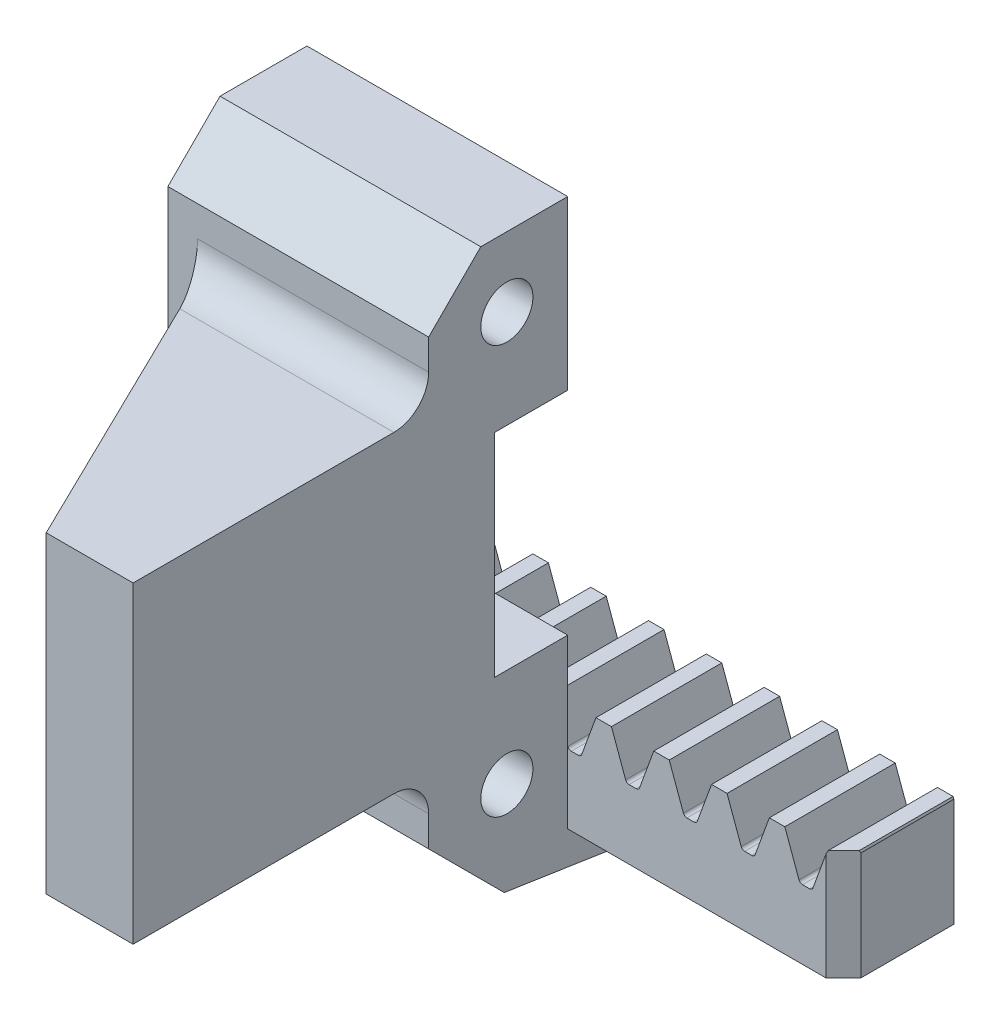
ISO-10303-21;
HEADER;
FILE_DESCRIPTION(('STEP AP214'),'2;1');
FILE_NAME('part.step','',(''),(''),'','','');
FILE_SCHEMA(('AUTOMOTIVE_DESIGN { 1 0 10303 214 1 1 1 1 }'));
ENDSEC;
DATA;
#1=APPLICATION_CONTEXT('core data for automotive mechanical design processes');
#2=APPLICATION_PROTOCOL_DEFINITION('international standard','automotive_design',2000,#1);
#3=PRODUCT_CONTEXT('',#1,'mechanical');
#4=PRODUCT('Part','Part','',(#3));
#5=PRODUCT_RELATED_PRODUCT_CATEGORY('part','',(#4));
#6=PRODUCT_DEFINITION_FORMATION('','',#4);
#7=PRODUCT_DEFINITION_CONTEXT('part definition',#1,'design');
#8=PRODUCT_DEFINITION('design','',#6,#7);
#9=PRODUCT_DEFINITION_SHAPE('','',#8);
#10=(LENGTH_UNIT() NAMED_UNIT(*) SI_UNIT(.MILLI.,.METRE.));
#11=(NAMED_UNIT(*) PLANE_ANGLE_UNIT() SI_UNIT($,.RADIAN.));
#12=(NAMED_UNIT(*) SI_UNIT($,.STERADIAN.) SOLID_ANGLE_UNIT());
#13=UNCERTAINTY_MEASURE_WITH_UNIT(LENGTH_MEASURE(1.E-05),#10,'distance_accuracy_value','');
#14=(GEOMETRIC_REPRESENTATION_CONTEXT(3) GLOBAL_UNCERTAINTY_ASSIGNED_CONTEXT((#13)) GLOBAL_UNIT_ASSIGNED_CONTEXT((#10,
#11,#12)) REPRESENTATION_CONTEXT('',''));
#15=CARTESIAN_POINT('',(0.,0.,0.));
#16=DIRECTION('',(0.,0.,1.));
#17=DIRECTION('',(1.,0.,0.));
#18=AXIS2_PLACEMENT_3D('',#15,#16,#17);
#19=CARTESIAN_POINT('',(-13.1188202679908,0.795866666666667,-3.175));
#20=DIRECTION('',(0.,1.,0.));
#21=DIRECTION('',(0.,0.,1.));
#22=AXIS2_PLACEMENT_3D('',#19,#20,#21);
#23=PLANE('',#22);
#24=DIRECTION('',(1.,0.,0.));
#25=VECTOR('',#24,1.);
#26=CARTESIAN_POINT('',(-13.1188202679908,0.795866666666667,-3.175));
#27=LINE('',#26,#25);
#28=CARTESIAN_POINT('',(-13.1188202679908,0.795866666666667,-3.175));
#29=VERTEX_POINT('',#28);
#30=CARTESIAN_POINT('',(-13.5252933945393,0.795866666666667,-3.175));
#31=VERTEX_POINT('',#30);
#32=EDGE_CURVE('E1171',#29,#31,#27,.F.);
#33=ORIENTED_EDGE('',*,*,#32,.T.);
#34=DIRECTION('',(0.,0.,1.));
#35=VECTOR('',#34,1.);
#36=CARTESIAN_POINT('',(-13.5252933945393,0.795866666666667,-3.175));
#37=LINE('',#36,#35);
#38=CARTESIAN_POINT('',(-13.5252933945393,0.795866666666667,3.175));
#39=VERTEX_POINT('',#38);
#40=EDGE_CURVE('E531',#31,#39,#37,.T.);
#41=ORIENTED_EDGE('',*,*,#40,.T.);
#42=DIRECTION('',(1.,0.,0.));
#43=VECTOR('',#42,1.);
#44=CARTESIAN_POINT('',(-13.1188202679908,0.795866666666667,3.175));
#45=LINE('',#44,#43);
#46=CARTESIAN_POINT('',(-13.1188202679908,0.795866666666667,3.175));
#47=VERTEX_POINT('',#46);
#48=EDGE_CURVE('E1182',#39,#47,#45,.T.);
#49=ORIENTED_EDGE('',*,*,#48,.T.);
#50=DIRECTION('',(0.,0.,1.));
#51=VECTOR('',#50,1.);
#52=CARTESIAN_POINT('',(-13.1188202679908,0.795866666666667,-3.175));
#53=LINE('',#52,#51);
#54=EDGE_CURVE('E1177',#47,#29,#53,.F.);
#55=ORIENTED_EDGE('',*,*,#54,.T.);
#56=EDGE_LOOP('',(#33,#41,#49,#55));
#57=FACE_BOUND('',#56,.T.);
#58=ADVANCED_FACE('F15',(#57),#23,.T.);
#59=CARTESIAN_POINT('',(-9.79396026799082,0.795866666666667,-3.175));
#60=DIRECTION('',(0.,1.,0.));
#61=DIRECTION('',(0.,0.,1.));
#62=AXIS2_PLACEMENT_3D('',#59,#60,#61);
#63=PLANE('',#62);
#64=DIRECTION('',(1.,0.,0.));
#65=VECTOR('',#64,1.);
#66=CARTESIAN_POINT('',(-9.79396026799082,0.795866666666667,-3.175));
#67=LINE('',#66,#65);
#68=CARTESIAN_POINT('',(-9.79396026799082,0.795866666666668,-3.175));
#69=VERTEX_POINT('',#68);
#70=CARTESIAN_POINT('',(-10.2004333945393,0.795866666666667,-3.175));
#71=VERTEX_POINT('',#70);
#72=EDGE_CURVE('E1160',#69,#71,#67,.F.);
#73=ORIENTED_EDGE('',*,*,#72,.T.);
#74=DIRECTION('',(0.,0.,1.));
#75=VECTOR('',#74,1.);
#76=CARTESIAN_POINT('',(-10.2004333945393,0.795866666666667,-3.175));
#77=LINE('',#76,#75);
#78=CARTESIAN_POINT('',(-10.2004333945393,0.795866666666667,3.175));
#79=VERTEX_POINT('',#78);
#80=EDGE_CURVE('E1173',#71,#79,#77,.T.);
#81=ORIENTED_EDGE('',*,*,#80,.T.);
#82=DIRECTION('',(1.,0.,0.));
#83=VECTOR('',#82,1.);
#84=CARTESIAN_POINT('',(-9.79396026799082,0.795866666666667,3.175));
#85=LINE('',#84,#83);
#86=CARTESIAN_POINT('',(-9.79396026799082,0.795866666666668,3.175));
#87=VERTEX_POINT('',#86);
#88=EDGE_CURVE('E1169',#79,#87,#85,.T.);
#89=ORIENTED_EDGE('',*,*,#88,.T.);
#90=DIRECTION('',(0.,0.,1.));
#91=VECTOR('',#90,1.);
#92=CARTESIAN_POINT('',(-9.79396026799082,0.795866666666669,-3.175));
#93=LINE('',#92,#91);
#94=EDGE_CURVE('E1045',#87,#69,#93,.F.);
#95=ORIENTED_EDGE('',*,*,#94,.T.);
#96=EDGE_LOOP('',(#73,#81,#89,#95));
#97=FACE_BOUND('',#96,.T.);
#98=ADVANCED_FACE('F2275',(#97),#63,.T.);
#99=CARTESIAN_POINT('',(-6.46910026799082,0.795866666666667,-3.175));
#100=DIRECTION('',(0.,1.,0.));
#101=DIRECTION('',(-1.,0.,0.));
#102=AXIS2_PLACEMENT_3D('',#99,#100,#101);
#103=PLANE('',#102);
#104=DIRECTION('',(-1.,0.,0.));
#105=VECTOR('',#104,1.);
#106=CARTESIAN_POINT('',(-6.46910026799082,0.795866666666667,-3.175));
#107=LINE('',#106,#105);
#108=CARTESIAN_POINT('',(-6.46910026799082,0.795866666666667,-3.175));
#109=VERTEX_POINT('',#108);
#110=CARTESIAN_POINT('',(-6.87557339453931,0.795866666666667,-3.175));
#111=VERTEX_POINT('',#110);
#112=EDGE_CURVE('E1149',#109,#111,#107,.T.);
#113=ORIENTED_EDGE('',*,*,#112,.T.);
#114=DIRECTION('',(0.,0.,1.));
#115=VECTOR('',#114,1.);
#116=CARTESIAN_POINT('',(-6.87557339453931,0.795866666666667,-3.175));
#117=LINE('',#116,#115);
#118=CARTESIAN_POINT('',(-6.87557339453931,0.795866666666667,3.175));
#119=VERTEX_POINT('',#118);
#120=EDGE_CURVE('E1162',#111,#119,#117,.T.);
#121=ORIENTED_EDGE('',*,*,#120,.T.);
#122=DIRECTION('',(-1.,0.,0.));
#123=VECTOR('',#122,1.);
#124=CARTESIAN_POINT('',(-6.46910026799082,0.795866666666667,3.175));
#125=LINE('',#124,#123);
#126=CARTESIAN_POINT('',(-6.46910026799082,0.795866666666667,3.175));
#127=VERTEX_POINT('',#126);
#128=EDGE_CURVE('E1158',#119,#127,#125,.F.);
#129=ORIENTED_EDGE('',*,*,#128,.T.);
#130=DIRECTION('',(0.,0.,1.));
#131=VECTOR('',#130,1.);
#132=CARTESIAN_POINT('',(-6.46910026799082,0.795866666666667,-3.175));
#133=LINE('',#132,#131);
#134=EDGE_CURVE('E1035',#127,#109,#133,.F.);
#135=ORIENTED_EDGE('',*,*,#134,.T.);
#136=EDGE_LOOP('',(#113,#121,#129,#135));
#137=FACE_BOUND('',#136,.T.);
#138=ADVANCED_FACE('F2266',(#137),#103,.T.);
#139=CARTESIAN_POINT('',(-3.14424026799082,0.795866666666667,-3.175));
#140=DIRECTION('',(0.,1.,0.));
#141=DIRECTION('',(0.,0.,1.));
#142=AXIS2_PLACEMENT_3D('',#139,#140,#141);
#143=PLANE('',#142);
#144=DIRECTION('',(1.,0.,0.));
#145=VECTOR('',#144,1.);
#146=CARTESIAN_POINT('',(-3.14424026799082,0.795866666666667,-3.175));
#147=LINE('',#146,#145);
#148=CARTESIAN_POINT('',(-3.14424026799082,0.795866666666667,-3.175));
#149=VERTEX_POINT('',#148);
#150=CARTESIAN_POINT('',(-3.55071339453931,0.795866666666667,-3.175));
#151=VERTEX_POINT('',#150);
#152=EDGE_CURVE('E1138',#149,#151,#147,.F.);
#153=ORIENTED_EDGE('',*,*,#152,.T.);
#154=DIRECTION('',(0.,0.,1.));
#155=VECTOR('',#154,1.);
#156=CARTESIAN_POINT('',(-3.55071339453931,0.795866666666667,-3.175));
#157=LINE('',#156,#155);
#158=CARTESIAN_POINT('',(-3.55071339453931,0.795866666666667,3.175));
#159=VERTEX_POINT('',#158);
#160=EDGE_CURVE('E1151',#151,#159,#157,.T.);
#161=ORIENTED_EDGE('',*,*,#160,.T.);
#162=DIRECTION('',(1.,0.,0.));
#163=VECTOR('',#162,1.);
#164=CARTESIAN_POINT('',(-3.14424026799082,0.795866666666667,3.175));
#165=LINE('',#164,#163);
#166=CARTESIAN_POINT('',(-3.14424026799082,0.795866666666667,3.175));
#167=VERTEX_POINT('',#166);
#168=EDGE_CURVE('E1147',#159,#167,#165,.T.);
#169=ORIENTED_EDGE('',*,*,#168,.T.);
#170=DIRECTION('',(0.,0.,1.));
#171=VECTOR('',#170,1.);
#172=CARTESIAN_POINT('',(-3.14424026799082,0.795866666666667,-3.175));
#173=LINE('',#172,#171);
#174=EDGE_CURVE('E1025',#167,#149,#173,.F.);
#175=ORIENTED_EDGE('',*,*,#174,.T.);
#176=EDGE_LOOP('',(#153,#161,#169,#175));
#177=FACE_BOUND('',#176,.T.);
#178=ADVANCED_FACE('F2257',(#177),#143,.T.);
#179=CARTESIAN_POINT('',(0.180619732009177,0.795866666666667,-3.175));
#180=DIRECTION('',(0.,1.,0.));
#181=DIRECTION('',(0.,0.,1.));
#182=AXIS2_PLACEMENT_3D('',#179,#180,#181);
#183=PLANE('',#182);
#184=DIRECTION('',(1.,0.,0.));
#185=VECTOR('',#184,1.);
#186=CARTESIAN_POINT('',(0.180619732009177,0.795866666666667,-3.175));
#187=LINE('',#186,#185);
#188=CARTESIAN_POINT('',(0.180619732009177,0.795866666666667,-3.175));
#189=VERTEX_POINT('',#188);
#190=CARTESIAN_POINT('',(-0.225853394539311,0.795866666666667,-3.175));
#191=VERTEX_POINT('',#190);
#192=EDGE_CURVE('E1127',#189,#191,#187,.F.);
#193=ORIENTED_EDGE('',*,*,#192,.T.);
#194=DIRECTION('',(0.,0.,1.));
#195=VECTOR('',#194,1.);
#196=CARTESIAN_POINT('',(-0.225853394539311,0.795866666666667,-3.175));
#197=LINE('',#196,#195);
#198=CARTESIAN_POINT('',(-0.225853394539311,0.795866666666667,3.175));
#199=VERTEX_POINT('',#198);
#200=EDGE_CURVE('E1140',#191,#199,#197,.T.);
#201=ORIENTED_EDGE('',*,*,#200,.T.);
#202=DIRECTION('',(1.,0.,0.));
#203=VECTOR('',#202,1.);
#204=CARTESIAN_POINT('',(0.180619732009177,0.795866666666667,3.175));
#205=LINE('',#204,#203);
#206=CARTESIAN_POINT('',(0.180619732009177,0.795866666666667,3.175));
#207=VERTEX_POINT('',#206);
#208=EDGE_CURVE('E1136',#199,#207,#205,.T.);
#209=ORIENTED_EDGE('',*,*,#208,.T.);
#210=DIRECTION('',(0.,0.,1.));
#211=VECTOR('',#210,1.);
#212=CARTESIAN_POINT('',(0.180619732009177,0.795866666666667,-3.175));
#213=LINE('',#212,#211);
#214=EDGE_CURVE('E1015',#207,#189,#213,.F.);
#215=ORIENTED_EDGE('',*,*,#214,.T.);
#216=EDGE_LOOP('',(#193,#201,#209,#215));
#217=FACE_BOUND('',#216,.T.);
#218=ADVANCED_FACE('F2248',(#217),#183,.T.);
#219=CARTESIAN_POINT('',(3.50547973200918,0.795866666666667,-3.175));
#220=DIRECTION('',(0.,1.,0.));
#221=DIRECTION('',(0.,0.,1.));
#222=AXIS2_PLACEMENT_3D('',#219,#220,#221);
#223=PLANE('',#222);
#224=DIRECTION('',(1.,0.,0.));
#225=VECTOR('',#224,1.);
#226=CARTESIAN_POINT('',(3.50547973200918,0.795866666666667,-3.175));
#227=LINE('',#226,#225);
#228=CARTESIAN_POINT('',(3.50547973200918,0.795866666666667,-3.175));
#229=VERTEX_POINT('',#228);
#230=CARTESIAN_POINT('',(3.09900660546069,0.795866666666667,-3.175));
#231=VERTEX_POINT('',#230);
#232=EDGE_CURVE('E1116',#229,#231,#227,.F.);
#233=ORIENTED_EDGE('',*,*,#232,.T.);
#234=DIRECTION('',(0.,0.,1.));
#235=VECTOR('',#234,1.);
#236=CARTESIAN_POINT('',(3.09900660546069,0.795866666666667,-3.175));
#237=LINE('',#236,#235);
#238=CARTESIAN_POINT('',(3.09900660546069,0.795866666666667,3.175));
#239=VERTEX_POINT('',#238);
#240=EDGE_CURVE('E1129',#231,#239,#237,.T.);
#241=ORIENTED_EDGE('',*,*,#240,.T.);
#242=DIRECTION('',(1.,0.,0.));
#243=VECTOR('',#242,1.);
#244=CARTESIAN_POINT('',(3.50547973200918,0.795866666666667,3.175));
#245=LINE('',#244,#243);
#246=CARTESIAN_POINT('',(3.50547973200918,0.795866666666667,3.175));
#247=VERTEX_POINT('',#246);
#248=EDGE_CURVE('E1125',#239,#247,#245,.T.);
#249=ORIENTED_EDGE('',*,*,#248,.T.);
#250=DIRECTION('',(0.,0.,1.));
#251=VECTOR('',#250,1.);
#252=CARTESIAN_POINT('',(3.50547973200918,0.795866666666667,-3.175));
#253=LINE('',#252,#251);
#254=EDGE_CURVE('E1005',#247,#229,#253,.F.);
#255=ORIENTED_EDGE('',*,*,#254,.T.);
#256=EDGE_LOOP('',(#233,#241,#249,#255));
#257=FACE_BOUND('',#256,.T.);
#258=ADVANCED_FACE('F2239',(#257),#223,.T.);
#259=CARTESIAN_POINT('',(6.83033973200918,0.795866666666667,-3.175));
#260=DIRECTION('',(0.,1.,0.));
#261=DIRECTION('',(0.,0.,1.));
#262=AXIS2_PLACEMENT_3D('',#259,#260,#261);
#263=PLANE('',#262);
#264=DIRECTION('',(1.,0.,0.));
#265=VECTOR('',#264,1.);
#266=CARTESIAN_POINT('',(6.83033973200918,0.795866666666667,-3.175));
#267=LINE('',#266,#265);
#268=CARTESIAN_POINT('',(6.83033973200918,0.795866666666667,-3.175));
#269=VERTEX_POINT('',#268);
#270=CARTESIAN_POINT('',(6.42386660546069,0.795866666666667,-3.175));
#271=VERTEX_POINT('',#270);
#272=EDGE_CURVE('E1105',#269,#271,#267,.F.);
#273=ORIENTED_EDGE('',*,*,#272,.T.);
#274=DIRECTION('',(0.,0.,1.));
#275=VECTOR('',#274,1.);
#276=CARTESIAN_POINT('',(6.42386660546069,0.795866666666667,-3.175));
#277=LINE('',#276,#275);
#278=CARTESIAN_POINT('',(6.42386660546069,0.795866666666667,3.175));
#279=VERTEX_POINT('',#278);
#280=EDGE_CURVE('E1118',#271,#279,#277,.T.);
#281=ORIENTED_EDGE('',*,*,#280,.T.);
#282=DIRECTION('',(1.,0.,0.));
#283=VECTOR('',#282,1.);
#284=CARTESIAN_POINT('',(6.83033973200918,0.795866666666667,3.175));
#285=LINE('',#284,#283);
#286=CARTESIAN_POINT('',(6.83033973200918,0.795866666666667,3.175));
#287=VERTEX_POINT('',#286);
#288=EDGE_CURVE('E1114',#279,#287,#285,.T.);
#289=ORIENTED_EDGE('',*,*,#288,.T.);
#290=DIRECTION('',(0.,0.,1.));
#291=VECTOR('',#290,1.);
#292=CARTESIAN_POINT('',(6.83033973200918,0.795866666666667,-3.175));
#293=LINE('',#292,#291);
#294=EDGE_CURVE('E995',#287,#269,#293,.F.);
#295=ORIENTED_EDGE('',*,*,#294,.T.);
#296=EDGE_LOOP('',(#273,#281,#289,#295));
#297=FACE_BOUND('',#296,.T.);
#298=ADVANCED_FACE('F2230',(#297),#263,.T.);
#299=CARTESIAN_POINT('',(10.1551997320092,0.795866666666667,-3.175));
#300=DIRECTION('',(0.,1.,0.));
#301=DIRECTION('',(-1.,0.,0.));
#302=AXIS2_PLACEMENT_3D('',#299,#300,#301);
#303=PLANE('',#302);
#304=DIRECTION('',(-1.,0.,0.));
#305=VECTOR('',#304,1.);
#306=CARTESIAN_POINT('',(10.1551997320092,0.795866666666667,-3.175));
#307=LINE('',#306,#305);
#308=CARTESIAN_POINT('',(10.1551997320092,0.795866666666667,-3.175));
#309=VERTEX_POINT('',#308);
#310=CARTESIAN_POINT('',(9.74872660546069,0.795866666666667,-3.175));
#311=VERTEX_POINT('',#310);
#312=EDGE_CURVE('E1094',#309,#311,#307,.T.);
#313=ORIENTED_EDGE('',*,*,#312,.T.);
#314=DIRECTION('',(0.,0.,1.));
#315=VECTOR('',#314,1.);
#316=CARTESIAN_POINT('',(9.74872660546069,0.795866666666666,-3.175));
#317=LINE('',#316,#315);
#318=CARTESIAN_POINT('',(9.74872660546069,0.795866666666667,3.175));
#319=VERTEX_POINT('',#318);
#320=EDGE_CURVE('E1107',#311,#319,#317,.T.);
#321=ORIENTED_EDGE('',*,*,#320,.T.);
#322=DIRECTION('',(-1.,0.,0.));
#323=VECTOR('',#322,1.);
#324=CARTESIAN_POINT('',(10.1551997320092,0.795866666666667,3.175));
#325=LINE('',#324,#323);
#326=CARTESIAN_POINT('',(10.1551997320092,0.795866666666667,3.175));
#327=VERTEX_POINT('',#326);
#328=EDGE_CURVE('E1103',#319,#327,#325,.F.);
#329=ORIENTED_EDGE('',*,*,#328,.T.);
#330=DIRECTION('',(0.,0.,1.));
#331=VECTOR('',#330,1.);
#332=CARTESIAN_POINT('',(10.1551997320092,0.795866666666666,-3.175));
#333=LINE('',#332,#331);
#334=EDGE_CURVE('E985',#327,#309,#333,.F.);
#335=ORIENTED_EDGE('',*,*,#334,.T.);
#336=EDGE_LOOP('',(#313,#321,#329,#335));
#337=FACE_BOUND('',#336,.T.);
#338=ADVANCED_FACE('F2221',(#337),#303,.T.);
#339=CARTESIAN_POINT('',(13.4800597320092,0.795866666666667,-3.175));
#340=DIRECTION('',(0.,1.,0.));
#341=DIRECTION('',(-1.,0.,0.));
#342=AXIS2_PLACEMENT_3D('',#339,#340,#341);
#343=PLANE('',#342);
#344=DIRECTION('',(-1.,0.,0.));
#345=VECTOR('',#344,1.);
#346=CARTESIAN_POINT('',(13.4800597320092,0.795866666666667,-3.175));
#347=LINE('',#346,#345);
#348=CARTESIAN_POINT('',(13.4800597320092,0.795866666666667,-3.175));
#349=VERTEX_POINT('',#348);
#350=CARTESIAN_POINT('',(13.0735866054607,0.795866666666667,-3.175));
#351=VERTEX_POINT('',#350);
#352=EDGE_CURVE('E534',#349,#351,#347,.T.);
#353=ORIENTED_EDGE('',*,*,#352,.T.);
#354=DIRECTION('',(0.,0.,1.));
#355=VECTOR('',#354,1.);
#356=CARTESIAN_POINT('',(13.0735866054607,0.795866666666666,-3.175));
#357=LINE('',#356,#355);
#358=CARTESIAN_POINT('',(13.0735866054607,0.795866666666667,3.175));
#359=VERTEX_POINT('',#358);
#360=EDGE_CURVE('E1096',#351,#359,#357,.T.);
#361=ORIENTED_EDGE('',*,*,#360,.T.);
#362=DIRECTION('',(-1.,0.,0.));
#363=VECTOR('',#362,1.);
#364=CARTESIAN_POINT('',(13.4800597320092,0.795866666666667,3.175));
#365=LINE('',#364,#363);
#366=CARTESIAN_POINT('',(13.4800597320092,0.795866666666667,3.175));
#367=VERTEX_POINT('',#366);
#368=EDGE_CURVE('E1092',#359,#367,#365,.F.);
#369=ORIENTED_EDGE('',*,*,#368,.T.);
#370=DIRECTION('',(0.,0.,1.));
#371=VECTOR('',#370,1.);
#372=CARTESIAN_POINT('',(13.4800597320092,0.795866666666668,-3.175));
#373=LINE('',#372,#371);
#374=EDGE_CURVE('E968',#367,#349,#373,.F.);
#375=ORIENTED_EDGE('',*,*,#374,.T.);
#376=EDGE_LOOP('',(#353,#361,#369,#375));
#377=FACE_BOUND('',#376,.T.);
#378=ADVANCED_FACE('F2213',(#377),#343,.T.);
#379=CARTESIAN_POINT('',(-13.5252933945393,1.00615653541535,-3.175));
#380=DIRECTION('',(0.,0.,1.));
#381=DIRECTION('',(1.,0.,0.));
#382=AXIS2_PLACEMENT_3D('',#379,#380,#381);
#383=CYLINDRICAL_SURFACE('',#382,0.210289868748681);
#384=ORIENTED_EDGE('',*,*,#40,.F.);
#385=CARTESIAN_POINT('',(-13.5252933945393,1.00615653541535,-3.175));
#386=DIRECTION('',(0.,0.,1.));
#387=DIRECTION('',(1.,0.,0.));
#388=AXIS2_PLACEMENT_3D('',#385,#386,#387);
#389=CIRCLE('',#388,0.210289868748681);
#390=CARTESIAN_POINT('',(-13.7229012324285,0.934233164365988,-3.175));
#391=VERTEX_POINT('',#390);
#392=EDGE_CURVE('E18',#391,#31,#389,.T.);
#393=ORIENTED_EDGE('',*,*,#392,.F.);
#394=DIRECTION('',(0.,0.,1.));
#395=VECTOR('',#394,1.);
#396=CARTESIAN_POINT('',(-13.7229012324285,0.934233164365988,-3.175));
#397=LINE('',#396,#395);
#398=CARTESIAN_POINT('',(-13.7229012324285,0.934233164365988,3.175));
#399=VERTEX_POINT('',#398);
#400=EDGE_CURVE('E528',#399,#391,#397,.F.);
#401=ORIENTED_EDGE('',*,*,#400,.F.);
#402=CARTESIAN_POINT('',(-13.5252933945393,1.00615653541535,3.175));
#403=DIRECTION('',(0.,0.,1.));
#404=DIRECTION('',(1.,0.,0.));
#405=AXIS2_PLACEMENT_3D('',#402,#403,#404);
#406=CIRCLE('',#405,0.210289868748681);
#407=EDGE_CURVE('E1181',#39,#399,#406,.F.);
#408=ORIENTED_EDGE('',*,*,#407,.F.);
#409=EDGE_LOOP('',(#384,#393,#401,#408));
#410=FACE_BOUND('',#409,.T.);
#411=ADVANCED_FACE('F526',(#410),#383,.F.);
#412=CARTESIAN_POINT('',(-13.1188202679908,1.00615653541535,-3.175));
#413=DIRECTION('',(0.,0.,1.));
#414=DIRECTION('',(1.,0.,0.));
#415=AXIS2_PLACEMENT_3D('',#412,#413,#414);
#416=CYLINDRICAL_SURFACE('',#415,0.210289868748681);
#417=DIRECTION('',(0.,0.,1.));
#418=VECTOR('',#417,1.);
#419=CARTESIAN_POINT('',(-12.9212124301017,0.934233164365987,-3.175));
#420=LINE('',#419,#418);
#421=CARTESIAN_POINT('',(-12.9212124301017,0.934233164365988,-3.175));
#422=VERTEX_POINT('',#421);
#423=CARTESIAN_POINT('',(-12.9212124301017,0.934233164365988,3.175));
#424=VERTEX_POINT('',#423);
#425=EDGE_CURVE('E885',#422,#424,#420,.T.);
#426=ORIENTED_EDGE('',*,*,#425,.F.);
#427=CARTESIAN_POINT('',(-13.1188202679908,1.00615653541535,-3.175));
#428=DIRECTION('',(0.,0.,1.));
#429=DIRECTION('',(1.,0.,0.));
#430=AXIS2_PLACEMENT_3D('',#427,#428,#429);
#431=CIRCLE('',#430,0.210289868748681);
#432=EDGE_CURVE('E1180',#29,#422,#431,.T.);
#433=ORIENTED_EDGE('',*,*,#432,.F.);
#434=ORIENTED_EDGE('',*,*,#54,.F.);
#435=CARTESIAN_POINT('',(-13.1188202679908,1.00615653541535,3.175));
#436=DIRECTION('',(0.,0.,1.));
#437=DIRECTION('',(1.,0.,0.));
#438=AXIS2_PLACEMENT_3D('',#435,#436,#437);
#439=CIRCLE('',#438,0.210289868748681);
#440=EDGE_CURVE('E1267',#424,#47,#439,.F.);
#441=ORIENTED_EDGE('',*,*,#440,.F.);
#442=EDGE_LOOP('',(#426,#433,#434,#441));
#443=FACE_BOUND('',#442,.T.);
#444=ADVANCED_FACE('F1277',(#443),#416,.F.);
#445=CARTESIAN_POINT('',(-10.2004333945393,1.00615653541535,-3.175));
#446=DIRECTION('',(0.,0.,1.));
#447=DIRECTION('',(1.,0.,0.));
#448=AXIS2_PLACEMENT_3D('',#445,#446,#447);
#449=CYLINDRICAL_SURFACE('',#448,0.210289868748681);
#450=ORIENTED_EDGE('',*,*,#80,.F.);
#451=CARTESIAN_POINT('',(-10.2004333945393,1.00615653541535,-3.175));
#452=DIRECTION('',(0.,0.,1.));
#453=DIRECTION('',(1.,0.,0.));
#454=AXIS2_PLACEMENT_3D('',#451,#452,#453);
#455=CIRCLE('',#454,0.210289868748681);
#456=CARTESIAN_POINT('',(-10.3980412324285,0.934233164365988,-3.175));
#457=VERTEX_POINT('',#456);
#458=EDGE_CURVE('E1176',#457,#71,#455,.T.);
#459=ORIENTED_EDGE('',*,*,#458,.F.);
#460=DIRECTION('',(0.,0.,1.));
#461=VECTOR('',#460,1.);
#462=CARTESIAN_POINT('',(-10.3980412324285,0.934233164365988,-3.175));
#463=LINE('',#462,#461);
#464=CARTESIAN_POINT('',(-10.3980412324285,0.934233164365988,3.175));
#465=VERTEX_POINT('',#464);
#466=EDGE_CURVE('E882',#465,#457,#463,.F.);
#467=ORIENTED_EDGE('',*,*,#466,.F.);
#468=CARTESIAN_POINT('',(-10.2004333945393,1.00615653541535,3.175));
#469=DIRECTION('',(0.,0.,1.));
#470=DIRECTION('',(1.,0.,0.));
#471=AXIS2_PLACEMENT_3D('',#468,#469,#470);
#472=CIRCLE('',#471,0.210289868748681);
#473=EDGE_CURVE('E1050',#79,#465,#472,.F.);
#474=ORIENTED_EDGE('',*,*,#473,.F.);
#475=EDGE_LOOP('',(#450,#459,#467,#474));
#476=FACE_BOUND('',#475,.T.);
#477=ADVANCED_FACE('F2190',(#476),#449,.F.);
#478=CARTESIAN_POINT('',(-11.2136136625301,3.175,-3.175));
#479=DIRECTION('',(0.,1.,0.));
#480=DIRECTION('',(-1.,0.,0.));
#481=AXIS2_PLACEMENT_3D('',#478,#479,#480);
#482=PLANE('',#481);
#483=DIRECTION('',(-1.,0.,0.));
#484=VECTOR('',#483,1.);
#485=CARTESIAN_POINT('',(-11.2136136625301,3.175,-3.175));
#486=LINE('',#485,#484);
#487=CARTESIAN_POINT('',(-11.2136136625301,3.175,-3.175));
#488=VERTEX_POINT('',#487);
#489=CARTESIAN_POINT('',(-12.10564,3.175,-3.175));
#490=VERTEX_POINT('',#489);
#491=EDGE_CURVE('E1043',#488,#490,#486,.T.);
#492=ORIENTED_EDGE('',*,*,#491,.T.);
#493=DIRECTION('',(0.,0.,1.));
#494=VECTOR('',#493,1.);
#495=CARTESIAN_POINT('',(-12.10564,3.175,-3.175));
#496=LINE('',#495,#494);
#497=CARTESIAN_POINT('',(-12.10564,3.175,3.175));
#498=VERTEX_POINT('',#497);
#499=EDGE_CURVE('E892',#498,#490,#496,.F.);
#500=ORIENTED_EDGE('',*,*,#499,.F.);
#501=DIRECTION('',(-1.,0.,0.));
#502=VECTOR('',#501,1.);
#503=CARTESIAN_POINT('',(-11.2136136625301,3.175,3.175));
#504=LINE('',#503,#502);
#505=CARTESIAN_POINT('',(-11.2136136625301,3.175,3.175));
#506=VERTEX_POINT('',#505);
#507=EDGE_CURVE('E1046',#498,#506,#504,.F.);
#508=ORIENTED_EDGE('',*,*,#507,.T.);
#509=DIRECTION('',(0.,0.,1.));
#510=VECTOR('',#509,1.);
#511=CARTESIAN_POINT('',(-11.2136136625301,3.175,-3.175));
#512=LINE('',#511,#510);
#513=EDGE_CURVE('E879',#488,#506,#512,.T.);
#514=ORIENTED_EDGE('',*,*,#513,.F.);
#515=EDGE_LOOP('',(#492,#500,#508,#514));
#516=FACE_BOUND('',#515,.T.);
#517=ADVANCED_FACE('F1287',(#516),#482,.T.);
#518=CARTESIAN_POINT('',(-9.79396026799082,1.00615653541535,-3.175));
#519=DIRECTION('',(0.,0.,1.));
#520=DIRECTION('',(1.,0.,0.));
#521=AXIS2_PLACEMENT_3D('',#518,#519,#520);
#522=CYLINDRICAL_SURFACE('',#521,0.21028986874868);
#523=DIRECTION('',(0.,0.,1.));
#524=VECTOR('',#523,1.);
#525=CARTESIAN_POINT('',(-9.59635243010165,0.934233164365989,-3.175));
#526=LINE('',#525,#524);
#527=CARTESIAN_POINT('',(-9.59635243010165,0.934233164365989,-3.175));
#528=VERTEX_POINT('',#527);
#529=CARTESIAN_POINT('',(-9.59635243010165,0.934233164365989,3.175));
#530=VERTEX_POINT('',#529);
#531=EDGE_CURVE('E869',#528,#530,#526,.T.);
#532=ORIENTED_EDGE('',*,*,#531,.F.);
#533=CARTESIAN_POINT('',(-9.79396026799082,1.00615653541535,-3.175));
#534=DIRECTION('',(0.,0.,1.));
#535=DIRECTION('',(1.,0.,0.));
#536=AXIS2_PLACEMENT_3D('',#533,#534,#535);
#537=CIRCLE('',#536,0.21028986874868);
#538=EDGE_CURVE('E1168',#69,#528,#537,.T.);
#539=ORIENTED_EDGE('',*,*,#538,.F.);
#540=ORIENTED_EDGE('',*,*,#94,.F.);
#541=CARTESIAN_POINT('',(-9.79396026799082,1.00615653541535,3.175));
#542=DIRECTION('',(0.,0.,1.));
#543=DIRECTION('',(1.,0.,0.));
#544=AXIS2_PLACEMENT_3D('',#541,#542,#543);
#545=CIRCLE('',#544,0.21028986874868);
#546=EDGE_CURVE('E1260',#530,#87,#545,.F.);
#547=ORIENTED_EDGE('',*,*,#546,.F.);
#548=EDGE_LOOP('',(#532,#539,#540,#547));
#549=FACE_BOUND('',#548,.T.);
#550=ADVANCED_FACE('F2173',(#549),#522,.F.);
#551=CARTESIAN_POINT('',(-6.87557339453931,1.00615653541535,-3.175));
#552=DIRECTION('',(0.,0.,1.));
#553=DIRECTION('',(1.,0.,0.));
#554=AXIS2_PLACEMENT_3D('',#551,#552,#553);
#555=CYLINDRICAL_SURFACE('',#554,0.210289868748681);
#556=ORIENTED_EDGE('',*,*,#120,.F.);
#557=CARTESIAN_POINT('',(-6.87557339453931,1.00615653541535,-3.175));
#558=DIRECTION('',(0.,0.,1.));
#559=DIRECTION('',(1.,0.,0.));
#560=AXIS2_PLACEMENT_3D('',#557,#558,#559);
#561=CIRCLE('',#560,0.210289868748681);
#562=CARTESIAN_POINT('',(-7.07318123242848,0.934233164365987,-3.175));
#563=VERTEX_POINT('',#562);
#564=EDGE_CURVE('E1165',#563,#111,#561,.T.);
#565=ORIENTED_EDGE('',*,*,#564,.F.);
#566=DIRECTION('',(0.,0.,1.));
#567=VECTOR('',#566,1.);
#568=CARTESIAN_POINT('',(-7.07318123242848,0.934233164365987,-3.175));
#569=LINE('',#568,#567);
#570=CARTESIAN_POINT('',(-7.07318123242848,0.934233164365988,3.175));
#571=VERTEX_POINT('',#570);
#572=EDGE_CURVE('E866',#571,#563,#569,.F.);
#573=ORIENTED_EDGE('',*,*,#572,.F.);
#574=CARTESIAN_POINT('',(-6.87557339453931,1.00615653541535,3.175));
#575=DIRECTION('',(0.,0.,1.));
#576=DIRECTION('',(1.,0.,0.));
#577=AXIS2_PLACEMENT_3D('',#574,#575,#576);
#578=CIRCLE('',#577,0.210289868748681);
#579=EDGE_CURVE('E1040',#119,#571,#578,.F.);
#580=ORIENTED_EDGE('',*,*,#579,.F.);
#581=EDGE_LOOP('',(#556,#565,#573,#580));
#582=FACE_BOUND('',#581,.T.);
#583=ADVANCED_FACE('F2164',(#582),#555,.F.);
#584=CARTESIAN_POINT('',(-7.88875366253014,3.175,-3.175));
#585=DIRECTION('',(0.,1.,0.));
#586=DIRECTION('',(-1.,0.,0.));
#587=AXIS2_PLACEMENT_3D('',#584,#585,#586);
#588=PLANE('',#587);
#589=DIRECTION('',(-1.,0.,0.));
#590=VECTOR('',#589,1.);
#591=CARTESIAN_POINT('',(-7.88875366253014,3.175,-3.175));
#592=LINE('',#591,#590);
#593=CARTESIAN_POINT('',(-7.88875366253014,3.175,-3.175));
#594=VERTEX_POINT('',#593);
#595=CARTESIAN_POINT('',(-8.78078,3.175,-3.175));
#596=VERTEX_POINT('',#595);
#597=EDGE_CURVE('E1033',#594,#596,#592,.T.);
#598=ORIENTED_EDGE('',*,*,#597,.T.);
#599=DIRECTION('',(0.,0.,1.));
#600=VECTOR('',#599,1.);
#601=CARTESIAN_POINT('',(-8.78078,3.175,-3.175));
#602=LINE('',#601,#600);
#603=CARTESIAN_POINT('',(-8.78078,3.175,3.175));
#604=VERTEX_POINT('',#603);
#605=EDGE_CURVE('E876',#604,#596,#602,.F.);
#606=ORIENTED_EDGE('',*,*,#605,.F.);
#607=DIRECTION('',(-1.,0.,0.));
#608=VECTOR('',#607,1.);
#609=CARTESIAN_POINT('',(-7.88875366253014,3.175,3.175));
#610=LINE('',#609,#608);
#611=CARTESIAN_POINT('',(-7.88875366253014,3.175,3.175));
#612=VERTEX_POINT('',#611);
#613=EDGE_CURVE('E1036',#604,#612,#610,.F.);
#614=ORIENTED_EDGE('',*,*,#613,.T.);
#615=DIRECTION('',(0.,0.,1.));
#616=VECTOR('',#615,1.);
#617=CARTESIAN_POINT('',(-7.88875366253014,3.175,-3.175));
#618=LINE('',#617,#616);
#619=EDGE_CURVE('E863',#594,#612,#618,.T.);
#620=ORIENTED_EDGE('',*,*,#619,.F.);
#621=EDGE_LOOP('',(#598,#606,#614,#620));
#622=FACE_BOUND('',#621,.T.);
#623=ADVANCED_FACE('F2155',(#622),#588,.T.);
#624=CARTESIAN_POINT('',(-6.46910026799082,1.00615653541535,-3.175));
#625=DIRECTION('',(0.,0.,1.));
#626=DIRECTION('',(1.,0.,0.));
#627=AXIS2_PLACEMENT_3D('',#624,#625,#626);
#628=CYLINDRICAL_SURFACE('',#627,0.210289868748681);
#629=DIRECTION('',(0.,0.,1.));
#630=VECTOR('',#629,1.);
#631=CARTESIAN_POINT('',(-6.27149243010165,0.934233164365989,-3.175));
#632=LINE('',#631,#630);
#633=CARTESIAN_POINT('',(-6.27149243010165,0.934233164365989,-3.175));
#634=VERTEX_POINT('',#633);
#635=CARTESIAN_POINT('',(-6.27149243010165,0.934233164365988,3.175));
#636=VERTEX_POINT('',#635);
#637=EDGE_CURVE('E853',#634,#636,#632,.T.);
#638=ORIENTED_EDGE('',*,*,#637,.F.);
#639=CARTESIAN_POINT('',(-6.46910026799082,1.00615653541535,-3.175));
#640=DIRECTION('',(0.,0.,1.));
#641=DIRECTION('',(1.,0.,0.));
#642=AXIS2_PLACEMENT_3D('',#639,#640,#641);
#643=CIRCLE('',#642,0.210289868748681);
#644=EDGE_CURVE('E1157',#109,#634,#643,.T.);
#645=ORIENTED_EDGE('',*,*,#644,.F.);
#646=ORIENTED_EDGE('',*,*,#134,.F.);
#647=CARTESIAN_POINT('',(-6.46910026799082,1.00615653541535,3.175));
#648=DIRECTION('',(0.,0.,1.));
#649=DIRECTION('',(1.,0.,0.));
#650=AXIS2_PLACEMENT_3D('',#647,#648,#649);
#651=CIRCLE('',#650,0.210289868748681);
#652=EDGE_CURVE('E1253',#636,#127,#651,.F.);
#653=ORIENTED_EDGE('',*,*,#652,.F.);
#654=EDGE_LOOP('',(#638,#645,#646,#653));
#655=FACE_BOUND('',#654,.T.);
#656=ADVANCED_FACE('F2146',(#655),#628,.F.);
#657=CARTESIAN_POINT('',(-3.55071339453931,1.00615653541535,-3.175));
#658=DIRECTION('',(0.,0.,1.));
#659=DIRECTION('',(1.,0.,0.));
#660=AXIS2_PLACEMENT_3D('',#657,#658,#659);
#661=CYLINDRICAL_SURFACE('',#660,0.21028986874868);
#662=ORIENTED_EDGE('',*,*,#160,.F.);
#663=CARTESIAN_POINT('',(-3.55071339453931,1.00615653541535,-3.175));
#664=DIRECTION('',(0.,0.,1.));
#665=DIRECTION('',(1.,0.,0.));
#666=AXIS2_PLACEMENT_3D('',#663,#664,#665);
#667=CIRCLE('',#666,0.21028986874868);
#668=CARTESIAN_POINT('',(-3.74832123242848,0.934233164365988,-3.175));
#669=VERTEX_POINT('',#668);
#670=EDGE_CURVE('E1154',#669,#151,#667,.T.);
#671=ORIENTED_EDGE('',*,*,#670,.F.);
#672=DIRECTION('',(0.,0.,1.));
#673=VECTOR('',#672,1.);
#674=CARTESIAN_POINT('',(-3.74832123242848,0.934233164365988,-3.175));
#675=LINE('',#674,#673);
#676=CARTESIAN_POINT('',(-3.74832123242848,0.934233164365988,3.175));
#677=VERTEX_POINT('',#676);
#678=EDGE_CURVE('E850',#677,#669,#675,.F.);
#679=ORIENTED_EDGE('',*,*,#678,.F.);
#680=CARTESIAN_POINT('',(-3.55071339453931,1.00615653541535,3.175));
#681=DIRECTION('',(0.,0.,1.));
#682=DIRECTION('',(1.,0.,0.));
#683=AXIS2_PLACEMENT_3D('',#680,#681,#682);
#684=CIRCLE('',#683,0.21028986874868);
#685=EDGE_CURVE('E1030',#159,#677,#684,.F.);
#686=ORIENTED_EDGE('',*,*,#685,.F.);
#687=EDGE_LOOP('',(#662,#671,#679,#686));
#688=FACE_BOUND('',#687,.T.);
#689=ADVANCED_FACE('F2137',(#688),#661,.F.);
#690=CARTESIAN_POINT('',(-4.56389366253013,3.175,-3.175));
#691=DIRECTION('',(0.,1.,0.));
#692=DIRECTION('',(-1.,0.,0.));
#693=AXIS2_PLACEMENT_3D('',#690,#691,#692);
#694=PLANE('',#693);
#695=DIRECTION('',(-1.,0.,0.));
#696=VECTOR('',#695,1.);
#697=CARTESIAN_POINT('',(-4.56389366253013,3.175,-3.175));
#698=LINE('',#697,#696);
#699=CARTESIAN_POINT('',(-4.56389366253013,3.175,-3.175));
#700=VERTEX_POINT('',#699);
#701=CARTESIAN_POINT('',(-5.45592,3.175,-3.175));
#702=VERTEX_POINT('',#701);
#703=EDGE_CURVE('E1023',#700,#702,#698,.T.);
#704=ORIENTED_EDGE('',*,*,#703,.T.);
#705=DIRECTION('',(0.,0.,1.));
#706=VECTOR('',#705,1.);
#707=CARTESIAN_POINT('',(-5.45592,3.175,-3.175));
#708=LINE('',#707,#706);
#709=CARTESIAN_POINT('',(-5.45592,3.175,3.175));
#710=VERTEX_POINT('',#709);
#711=EDGE_CURVE('E860',#710,#702,#708,.F.);
#712=ORIENTED_EDGE('',*,*,#711,.F.);
#713=DIRECTION('',(-1.,0.,0.));
#714=VECTOR('',#713,1.);
#715=CARTESIAN_POINT('',(-4.56389366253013,3.175,3.175));
#716=LINE('',#715,#714);
#717=CARTESIAN_POINT('',(-4.56389366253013,3.175,3.175));
#718=VERTEX_POINT('',#717);
#719=EDGE_CURVE('E1026',#710,#718,#716,.F.);
#720=ORIENTED_EDGE('',*,*,#719,.T.);
#721=DIRECTION('',(0.,0.,1.));
#722=VECTOR('',#721,1.);
#723=CARTESIAN_POINT('',(-4.56389366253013,3.175,-3.175));
#724=LINE('',#723,#722);
#725=EDGE_CURVE('E847',#700,#718,#724,.T.);
#726=ORIENTED_EDGE('',*,*,#725,.F.);
#727=EDGE_LOOP('',(#704,#712,#720,#726));
#728=FACE_BOUND('',#727,.T.);
#729=ADVANCED_FACE('F2128',(#728),#694,.T.);
#730=CARTESIAN_POINT('',(-3.14424026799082,1.00615653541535,-3.175));
#731=DIRECTION('',(0.,0.,1.));
#732=DIRECTION('',(1.,0.,0.));
#733=AXIS2_PLACEMENT_3D('',#730,#731,#732);
#734=CYLINDRICAL_SURFACE('',#733,0.21028986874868);
#735=DIRECTION('',(0.,0.,1.));
#736=VECTOR('',#735,1.);
#737=CARTESIAN_POINT('',(-2.94663243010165,0.934233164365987,-3.175));
#738=LINE('',#737,#736);
#739=CARTESIAN_POINT('',(-2.94663243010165,0.934233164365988,-3.175));
#740=VERTEX_POINT('',#739);
#741=CARTESIAN_POINT('',(-2.94663243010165,0.934233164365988,3.175));
#742=VERTEX_POINT('',#741);
#743=EDGE_CURVE('E837',#740,#742,#738,.T.);
#744=ORIENTED_EDGE('',*,*,#743,.F.);
#745=CARTESIAN_POINT('',(-3.14424026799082,1.00615653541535,-3.175));
#746=DIRECTION('',(0.,0.,1.));
#747=DIRECTION('',(1.,0.,0.));
#748=AXIS2_PLACEMENT_3D('',#745,#746,#747);
#749=CIRCLE('',#748,0.21028986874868);
#750=EDGE_CURVE('E1146',#149,#740,#749,.T.);
#751=ORIENTED_EDGE('',*,*,#750,.F.);
#752=ORIENTED_EDGE('',*,*,#174,.F.);
#753=CARTESIAN_POINT('',(-3.14424026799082,1.00615653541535,3.175));
#754=DIRECTION('',(0.,0.,1.));
#755=DIRECTION('',(1.,0.,0.));
#756=AXIS2_PLACEMENT_3D('',#753,#754,#755);
#757=CIRCLE('',#756,0.21028986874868);
#758=EDGE_CURVE('E1246',#742,#167,#757,.F.);
#759=ORIENTED_EDGE('',*,*,#758,.F.);
#760=EDGE_LOOP('',(#744,#751,#752,#759));
#761=FACE_BOUND('',#760,.T.);
#762=ADVANCED_FACE('F2119',(#761),#734,.F.);
#763=CARTESIAN_POINT('',(-0.225853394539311,1.00615653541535,-3.175));
#764=DIRECTION('',(0.,0.,1.));
#765=DIRECTION('',(1.,0.,0.));
#766=AXIS2_PLACEMENT_3D('',#763,#764,#765);
#767=CYLINDRICAL_SURFACE('',#766,0.210289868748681);
#768=ORIENTED_EDGE('',*,*,#200,.F.);
#769=CARTESIAN_POINT('',(-0.225853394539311,1.00615653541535,-3.175));
#770=DIRECTION('',(0.,0.,1.));
#771=DIRECTION('',(1.,0.,0.));
#772=AXIS2_PLACEMENT_3D('',#769,#770,#771);
#773=CIRCLE('',#772,0.210289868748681);
#774=CARTESIAN_POINT('',(-0.423461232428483,0.934233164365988,-3.175));
#775=VERTEX_POINT('',#774);
#776=EDGE_CURVE('E1143',#775,#191,#773,.T.);
#777=ORIENTED_EDGE('',*,*,#776,.F.);
#778=DIRECTION('',(0.,0.,1.));
#779=VECTOR('',#778,1.);
#780=CARTESIAN_POINT('',(-0.423461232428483,0.934233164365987,-3.175));
#781=LINE('',#780,#779);
#782=CARTESIAN_POINT('',(-0.423461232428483,0.934233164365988,3.175));
#783=VERTEX_POINT('',#782);
#784=EDGE_CURVE('E834',#783,#775,#781,.F.);
#785=ORIENTED_EDGE('',*,*,#784,.F.);
#786=CARTESIAN_POINT('',(-0.225853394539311,1.00615653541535,3.175));
#787=DIRECTION('',(0.,0.,1.));
#788=DIRECTION('',(1.,0.,0.));
#789=AXIS2_PLACEMENT_3D('',#786,#787,#788);
#790=CIRCLE('',#789,0.210289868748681);
#791=EDGE_CURVE('E1020',#199,#783,#790,.F.);
#792=ORIENTED_EDGE('',*,*,#791,.F.);
#793=EDGE_LOOP('',(#768,#777,#785,#792));
#794=FACE_BOUND('',#793,.T.);
#795=ADVANCED_FACE('F2110',(#794),#767,.F.);
#796=CARTESIAN_POINT('',(-1.23903366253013,3.175,-3.175));
#797=DIRECTION('',(0.,1.,0.));
#798=DIRECTION('',(0.,0.,1.));
#799=AXIS2_PLACEMENT_3D('',#796,#797,#798);
#800=PLANE('',#799);
#801=DIRECTION('',(1.,0.,0.));
#802=VECTOR('',#801,1.);
#803=CARTESIAN_POINT('',(-1.23903366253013,3.175,-3.175));
#804=LINE('',#803,#802);
#805=CARTESIAN_POINT('',(-1.23903366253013,3.175,-3.175));
#806=VERTEX_POINT('',#805);
#807=CARTESIAN_POINT('',(-2.13106,3.175,-3.175));
#808=VERTEX_POINT('',#807);
#809=EDGE_CURVE('E1013',#806,#808,#804,.F.);
#810=ORIENTED_EDGE('',*,*,#809,.T.);
#811=DIRECTION('',(0.,0.,1.));
#812=VECTOR('',#811,1.);
#813=CARTESIAN_POINT('',(-2.13106,3.175,-3.175));
#814=LINE('',#813,#812);
#815=CARTESIAN_POINT('',(-2.13106,3.175,3.175));
#816=VERTEX_POINT('',#815);
#817=EDGE_CURVE('E844',#816,#808,#814,.F.);
#818=ORIENTED_EDGE('',*,*,#817,.F.);
#819=DIRECTION('',(1.,0.,0.));
#820=VECTOR('',#819,1.);
#821=CARTESIAN_POINT('',(-1.23903366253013,3.175,3.175));
#822=LINE('',#821,#820);
#823=CARTESIAN_POINT('',(-1.23903366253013,3.175,3.175));
#824=VERTEX_POINT('',#823);
#825=EDGE_CURVE('E1016',#816,#824,#822,.T.);
#826=ORIENTED_EDGE('',*,*,#825,.T.);
#827=DIRECTION('',(0.,0.,1.));
#828=VECTOR('',#827,1.);
#829=CARTESIAN_POINT('',(-1.23903366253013,3.175,-3.175));
#830=LINE('',#829,#828);
#831=EDGE_CURVE('E831',#806,#824,#830,.T.);
#832=ORIENTED_EDGE('',*,*,#831,.F.);
#833=EDGE_LOOP('',(#810,#818,#826,#832));
#834=FACE_BOUND('',#833,.T.);
#835=ADVANCED_FACE('F2101',(#834),#800,.T.);
#836=CARTESIAN_POINT('',(0.180619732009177,1.00615653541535,-3.175));
#837=DIRECTION('',(0.,0.,1.));
#838=DIRECTION('',(1.,0.,0.));
#839=AXIS2_PLACEMENT_3D('',#836,#837,#838);
#840=CYLINDRICAL_SURFACE('',#839,0.210289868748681);
#841=DIRECTION('',(0.,0.,1.));
#842=VECTOR('',#841,1.);
#843=CARTESIAN_POINT('',(0.378227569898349,0.934233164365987,-3.175));
#844=LINE('',#843,#842);
#845=CARTESIAN_POINT('',(0.378227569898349,0.934233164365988,-3.175));
#846=VERTEX_POINT('',#845);
#847=CARTESIAN_POINT('',(0.378227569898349,0.934233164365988,3.175));
#848=VERTEX_POINT('',#847);
#849=EDGE_CURVE('E821',#846,#848,#844,.T.);
#850=ORIENTED_EDGE('',*,*,#849,.F.);
#851=CARTESIAN_POINT('',(0.180619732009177,1.00615653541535,-3.175));
#852=DIRECTION('',(0.,0.,1.));
#853=DIRECTION('',(1.,0.,0.));
#854=AXIS2_PLACEMENT_3D('',#851,#852,#853);
#855=CIRCLE('',#854,0.210289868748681);
#856=EDGE_CURVE('E1135',#189,#846,#855,.T.);
#857=ORIENTED_EDGE('',*,*,#856,.F.);
#858=ORIENTED_EDGE('',*,*,#214,.F.);
#859=CARTESIAN_POINT('',(0.180619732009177,1.00615653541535,3.175));
#860=DIRECTION('',(0.,0.,1.));
#861=DIRECTION('',(1.,0.,0.));
#862=AXIS2_PLACEMENT_3D('',#859,#860,#861);
#863=CIRCLE('',#862,0.210289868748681);
#864=EDGE_CURVE('E1239',#848,#207,#863,.F.);
#865=ORIENTED_EDGE('',*,*,#864,.F.);
#866=EDGE_LOOP('',(#850,#857,#858,#865));
#867=FACE_BOUND('',#866,.T.);
#868=ADVANCED_FACE('F2092',(#867),#840,.F.);
#869=CARTESIAN_POINT('',(3.09900660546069,1.00615653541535,-3.175));
#870=DIRECTION('',(0.,0.,1.));
#871=DIRECTION('',(1.,0.,0.));
#872=AXIS2_PLACEMENT_3D('',#869,#870,#871);
#873=CYLINDRICAL_SURFACE('',#872,0.21028986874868);
#874=ORIENTED_EDGE('',*,*,#240,.F.);
#875=CARTESIAN_POINT('',(3.09900660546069,1.00615653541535,-3.175));
#876=DIRECTION('',(0.,0.,1.));
#877=DIRECTION('',(1.,0.,0.));
#878=AXIS2_PLACEMENT_3D('',#875,#876,#877);
#879=CIRCLE('',#878,0.21028986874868);
#880=CARTESIAN_POINT('',(2.90139876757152,0.934233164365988,-3.175));
#881=VERTEX_POINT('',#880);
#882=EDGE_CURVE('E1132',#881,#231,#879,.T.);
#883=ORIENTED_EDGE('',*,*,#882,.F.);
#884=DIRECTION('',(0.,0.,1.));
#885=VECTOR('',#884,1.);
#886=CARTESIAN_POINT('',(2.90139876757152,0.934233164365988,-3.175));
#887=LINE('',#886,#885);
#888=CARTESIAN_POINT('',(2.90139876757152,0.934233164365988,3.175));
#889=VERTEX_POINT('',#888);
#890=EDGE_CURVE('E818',#889,#881,#887,.F.);
#891=ORIENTED_EDGE('',*,*,#890,.F.);
#892=CARTESIAN_POINT('',(3.09900660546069,1.00615653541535,3.175));
#893=DIRECTION('',(0.,0.,1.));
#894=DIRECTION('',(1.,0.,0.));
#895=AXIS2_PLACEMENT_3D('',#892,#893,#894);
#896=CIRCLE('',#895,0.21028986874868);
#897=EDGE_CURVE('E1010',#239,#889,#896,.F.);
#898=ORIENTED_EDGE('',*,*,#897,.F.);
#899=EDGE_LOOP('',(#874,#883,#891,#898));
#900=FACE_BOUND('',#899,.T.);
#901=ADVANCED_FACE('F2083',(#900),#873,.F.);
#902=CARTESIAN_POINT('',(2.08582633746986,3.175,-3.175));
#903=DIRECTION('',(0.,1.,0.));
#904=DIRECTION('',(-1.,0.,0.));
#905=AXIS2_PLACEMENT_3D('',#902,#903,#904);
#906=PLANE('',#905);
#907=DIRECTION('',(-1.,0.,0.));
#908=VECTOR('',#907,1.);
#909=CARTESIAN_POINT('',(2.08582633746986,3.175,-3.175));
#910=LINE('',#909,#908);
#911=CARTESIAN_POINT('',(2.08582633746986,3.175,-3.175));
#912=VERTEX_POINT('',#911);
#913=CARTESIAN_POINT('',(1.1938,3.175,-3.175));
#914=VERTEX_POINT('',#913);
#915=EDGE_CURVE('E1003',#912,#914,#910,.T.);
#916=ORIENTED_EDGE('',*,*,#915,.T.);
#917=DIRECTION('',(0.,0.,1.));
#918=VECTOR('',#917,1.);
#919=CARTESIAN_POINT('',(1.1938,3.175,-3.175));
#920=LINE('',#919,#918);
#921=CARTESIAN_POINT('',(1.1938,3.175,3.175));
#922=VERTEX_POINT('',#921);
#923=EDGE_CURVE('E828',#922,#914,#920,.F.);
#924=ORIENTED_EDGE('',*,*,#923,.F.);
#925=DIRECTION('',(-1.,0.,0.));
#926=VECTOR('',#925,1.);
#927=CARTESIAN_POINT('',(2.08582633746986,3.175,3.175));
#928=LINE('',#927,#926);
#929=CARTESIAN_POINT('',(2.08582633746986,3.175,3.175));
#930=VERTEX_POINT('',#929);
#931=EDGE_CURVE('E1006',#922,#930,#928,.F.);
#932=ORIENTED_EDGE('',*,*,#931,.T.);
#933=DIRECTION('',(0.,0.,1.));
#934=VECTOR('',#933,1.);
#935=CARTESIAN_POINT('',(2.08582633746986,3.175,-3.175));
#936=LINE('',#935,#934);
#937=EDGE_CURVE('E815',#912,#930,#936,.T.);
#938=ORIENTED_EDGE('',*,*,#937,.F.);
#939=EDGE_LOOP('',(#916,#924,#932,#938));
#940=FACE_BOUND('',#939,.T.);
#941=ADVANCED_FACE('F2074',(#940),#906,.T.);
#942=CARTESIAN_POINT('',(3.50547973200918,1.00615653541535,-3.175));
#943=DIRECTION('',(0.,0.,1.));
#944=DIRECTION('',(1.,0.,0.));
#945=AXIS2_PLACEMENT_3D('',#942,#943,#944);
#946=CYLINDRICAL_SURFACE('',#945,0.210289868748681);
#947=DIRECTION('',(0.,0.,1.));
#948=VECTOR('',#947,1.);
#949=CARTESIAN_POINT('',(3.70308756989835,0.934233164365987,-3.175));
#950=LINE('',#949,#948);
#951=CARTESIAN_POINT('',(3.70308756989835,0.934233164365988,-3.175));
#952=VERTEX_POINT('',#951);
#953=CARTESIAN_POINT('',(3.70308756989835,0.934233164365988,3.175));
#954=VERTEX_POINT('',#953);
#955=EDGE_CURVE('E805',#952,#954,#950,.T.);
#956=ORIENTED_EDGE('',*,*,#955,.F.);
#957=CARTESIAN_POINT('',(3.50547973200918,1.00615653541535,-3.175));
#958=DIRECTION('',(0.,0.,1.));
#959=DIRECTION('',(1.,0.,0.));
#960=AXIS2_PLACEMENT_3D('',#957,#958,#959);
#961=CIRCLE('',#960,0.210289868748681);
#962=EDGE_CURVE('E1124',#229,#952,#961,.T.);
#963=ORIENTED_EDGE('',*,*,#962,.F.);
#964=ORIENTED_EDGE('',*,*,#254,.F.);
#965=CARTESIAN_POINT('',(3.50547973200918,1.00615653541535,3.175));
#966=DIRECTION('',(0.,0.,1.));
#967=DIRECTION('',(1.,0.,0.));
#968=AXIS2_PLACEMENT_3D('',#965,#966,#967);
#969=CIRCLE('',#968,0.210289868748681);
#970=EDGE_CURVE('E1232',#954,#247,#969,.F.);
#971=ORIENTED_EDGE('',*,*,#970,.F.);
#972=EDGE_LOOP('',(#956,#963,#964,#971));
#973=FACE_BOUND('',#972,.T.);
#974=ADVANCED_FACE('F2065',(#973),#946,.F.);
#975=CARTESIAN_POINT('',(6.42386660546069,1.00615653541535,-3.175));
#976=DIRECTION('',(0.,0.,1.));
#977=DIRECTION('',(1.,0.,0.));
#978=AXIS2_PLACEMENT_3D('',#975,#976,#977);
#979=CYLINDRICAL_SURFACE('',#978,0.21028986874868);
#980=ORIENTED_EDGE('',*,*,#280,.F.);
#981=CARTESIAN_POINT('',(6.42386660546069,1.00615653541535,-3.175));
#982=DIRECTION('',(0.,0.,1.));
#983=DIRECTION('',(1.,0.,0.));
#984=AXIS2_PLACEMENT_3D('',#981,#982,#983);
#985=CIRCLE('',#984,0.21028986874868);
#986=CARTESIAN_POINT('',(6.22625876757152,0.934233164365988,-3.175));
#987=VERTEX_POINT('',#986);
#988=EDGE_CURVE('E1121',#987,#271,#985,.T.);
#989=ORIENTED_EDGE('',*,*,#988,.F.);
#990=DIRECTION('',(0.,0.,1.));
#991=VECTOR('',#990,1.);
#992=CARTESIAN_POINT('',(6.22625876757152,0.934233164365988,-3.175));
#993=LINE('',#992,#991);
#994=CARTESIAN_POINT('',(6.22625876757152,0.934233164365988,3.175));
#995=VERTEX_POINT('',#994);
#996=EDGE_CURVE('E802',#995,#987,#993,.F.);
#997=ORIENTED_EDGE('',*,*,#996,.F.);
#998=CARTESIAN_POINT('',(6.42386660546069,1.00615653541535,3.175));
#999=DIRECTION('',(0.,0.,1.));
#1000=DIRECTION('',(1.,0.,0.));
#1001=AXIS2_PLACEMENT_3D('',#998,#999,#1000);
#1002=CIRCLE('',#1001,0.21028986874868);
#1003=EDGE_CURVE('E1000',#279,#995,#1002,.F.);
#1004=ORIENTED_EDGE('',*,*,#1003,.F.);
#1005=EDGE_LOOP('',(#980,#989,#997,#1004));
#1006=FACE_BOUND('',#1005,.T.);
#1007=ADVANCED_FACE('F2056',(#1006),#979,.F.);
#1008=CARTESIAN_POINT('',(5.41068633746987,3.175,-3.175));
#1009=DIRECTION('',(0.,1.,0.));
#1010=DIRECTION('',(-1.,0.,0.));
#1011=AXIS2_PLACEMENT_3D('',#1008,#1009,#1010);
#1012=PLANE('',#1011);
#1013=DIRECTION('',(-1.,0.,0.));
#1014=VECTOR('',#1013,1.);
#1015=CARTESIAN_POINT('',(5.41068633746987,3.175,-3.175));
#1016=LINE('',#1015,#1014);
#1017=CARTESIAN_POINT('',(5.41068633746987,3.175,-3.175));
#1018=VERTEX_POINT('',#1017);
#1019=CARTESIAN_POINT('',(4.51866,3.175,-3.175));
#1020=VERTEX_POINT('',#1019);
#1021=EDGE_CURVE('E993',#1018,#1020,#1016,.T.);
#1022=ORIENTED_EDGE('',*,*,#1021,.T.);
#1023=DIRECTION('',(0.,0.,1.));
#1024=VECTOR('',#1023,1.);
#1025=CARTESIAN_POINT('',(4.51866,3.175,-3.175));
#1026=LINE('',#1025,#1024);
#1027=CARTESIAN_POINT('',(4.51866,3.175,3.175));
#1028=VERTEX_POINT('',#1027);
#1029=EDGE_CURVE('E812',#1028,#1020,#1026,.F.);
#1030=ORIENTED_EDGE('',*,*,#1029,.F.);
#1031=DIRECTION('',(-1.,0.,0.));
#1032=VECTOR('',#1031,1.);
#1033=CARTESIAN_POINT('',(5.41068633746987,3.175,3.175));
#1034=LINE('',#1033,#1032);
#1035=CARTESIAN_POINT('',(5.41068633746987,3.175,3.175));
#1036=VERTEX_POINT('',#1035);
#1037=EDGE_CURVE('E996',#1028,#1036,#1034,.F.);
#1038=ORIENTED_EDGE('',*,*,#1037,.T.);
#1039=DIRECTION('',(0.,0.,1.));
#1040=VECTOR('',#1039,1.);
#1041=CARTESIAN_POINT('',(5.41068633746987,3.175,-3.175));
#1042=LINE('',#1041,#1040);
#1043=EDGE_CURVE('E799',#1018,#1036,#1042,.T.);
#1044=ORIENTED_EDGE('',*,*,#1043,.F.);
#1045=EDGE_LOOP('',(#1022,#1030,#1038,#1044));
#1046=FACE_BOUND('',#1045,.T.);
#1047=ADVANCED_FACE('F2047',(#1046),#1012,.T.);
#1048=CARTESIAN_POINT('',(6.83033973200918,1.00615653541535,-3.175));
#1049=DIRECTION('',(0.,0.,1.));
#1050=DIRECTION('',(1.,0.,0.));
#1051=AXIS2_PLACEMENT_3D('',#1048,#1049,#1050);
#1052=CYLINDRICAL_SURFACE('',#1051,0.21028986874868);
#1053=DIRECTION('',(0.,0.,1.));
#1054=VECTOR('',#1053,1.);
#1055=CARTESIAN_POINT('',(7.02794756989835,0.934233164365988,-3.175));
#1056=LINE('',#1055,#1054);
#1057=CARTESIAN_POINT('',(7.02794756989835,0.934233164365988,-3.175));
#1058=VERTEX_POINT('',#1057);
#1059=CARTESIAN_POINT('',(7.02794756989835,0.934233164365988,3.175));
#1060=VERTEX_POINT('',#1059);
#1061=EDGE_CURVE('E789',#1058,#1060,#1056,.T.);
#1062=ORIENTED_EDGE('',*,*,#1061,.F.);
#1063=CARTESIAN_POINT('',(6.83033973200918,1.00615653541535,-3.175));
#1064=DIRECTION('',(0.,0.,1.));
#1065=DIRECTION('',(1.,0.,0.));
#1066=AXIS2_PLACEMENT_3D('',#1063,#1064,#1065);
#1067=CIRCLE('',#1066,0.21028986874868);
#1068=EDGE_CURVE('E1113',#269,#1058,#1067,.T.);
#1069=ORIENTED_EDGE('',*,*,#1068,.F.);
#1070=ORIENTED_EDGE('',*,*,#294,.F.);
#1071=CARTESIAN_POINT('',(6.83033973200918,1.00615653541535,3.175));
#1072=DIRECTION('',(0.,0.,1.));
#1073=DIRECTION('',(1.,0.,0.));
#1074=AXIS2_PLACEMENT_3D('',#1071,#1072,#1073);
#1075=CIRCLE('',#1074,0.21028986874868);
#1076=EDGE_CURVE('E1225',#1060,#287,#1075,.F.);
#1077=ORIENTED_EDGE('',*,*,#1076,.F.);
#1078=EDGE_LOOP('',(#1062,#1069,#1070,#1077));
#1079=FACE_BOUND('',#1078,.T.);
#1080=ADVANCED_FACE('F2038',(#1079),#1052,.F.);
#1081=CARTESIAN_POINT('',(9.74872660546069,1.00615653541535,-3.175));
#1082=DIRECTION('',(0.,0.,1.));
#1083=DIRECTION('',(1.,0.,0.));
#1084=AXIS2_PLACEMENT_3D('',#1081,#1082,#1083);
#1085=CYLINDRICAL_SURFACE('',#1084,0.210289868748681);
#1086=ORIENTED_EDGE('',*,*,#320,.F.);
#1087=CARTESIAN_POINT('',(9.74872660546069,1.00615653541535,-3.175));
#1088=DIRECTION('',(0.,0.,1.));
#1089=DIRECTION('',(1.,0.,0.));
#1090=AXIS2_PLACEMENT_3D('',#1087,#1088,#1089);
#1091=CIRCLE('',#1090,0.210289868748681);
#1092=CARTESIAN_POINT('',(9.55111876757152,0.934233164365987,-3.175));
#1093=VERTEX_POINT('',#1092);
#1094=EDGE_CURVE('E1110',#1093,#311,#1091,.T.);
#1095=ORIENTED_EDGE('',*,*,#1094,.F.);
#1096=DIRECTION('',(0.,0.,1.));
#1097=VECTOR('',#1096,1.);
#1098=CARTESIAN_POINT('',(9.55111876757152,0.934233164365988,-3.175));
#1099=LINE('',#1098,#1097);
#1100=CARTESIAN_POINT('',(9.55111876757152,0.934233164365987,3.175));
#1101=VERTEX_POINT('',#1100);
#1102=EDGE_CURVE('E786',#1101,#1093,#1099,.F.);
#1103=ORIENTED_EDGE('',*,*,#1102,.F.);
#1104=CARTESIAN_POINT('',(9.74872660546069,1.00615653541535,3.175));
#1105=DIRECTION('',(0.,0.,1.));
#1106=DIRECTION('',(1.,0.,0.));
#1107=AXIS2_PLACEMENT_3D('',#1104,#1105,#1106);
#1108=CIRCLE('',#1107,0.210289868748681);
#1109=EDGE_CURVE('E990',#319,#1101,#1108,.F.);
#1110=ORIENTED_EDGE('',*,*,#1109,.F.);
#1111=EDGE_LOOP('',(#1086,#1095,#1103,#1110));
#1112=FACE_BOUND('',#1111,.T.);
#1113=ADVANCED_FACE('F2029',(#1112),#1085,.F.);
#1114=CARTESIAN_POINT('',(8.73554633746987,3.175,-3.175));
#1115=DIRECTION('',(0.,1.,0.));
#1116=DIRECTION('',(-1.,0.,0.));
#1117=AXIS2_PLACEMENT_3D('',#1114,#1115,#1116);
#1118=PLANE('',#1117);
#1119=DIRECTION('',(-1.,0.,0.));
#1120=VECTOR('',#1119,1.);
#1121=CARTESIAN_POINT('',(8.73554633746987,3.175,-3.175));
#1122=LINE('',#1121,#1120);
#1123=CARTESIAN_POINT('',(8.73554633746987,3.175,-3.175));
#1124=VERTEX_POINT('',#1123);
#1125=CARTESIAN_POINT('',(7.84352,3.175,-3.175));
#1126=VERTEX_POINT('',#1125);
#1127=EDGE_CURVE('E983',#1124,#1126,#1122,.T.);
#1128=ORIENTED_EDGE('',*,*,#1127,.T.);
#1129=DIRECTION('',(0.,0.,1.));
#1130=VECTOR('',#1129,1.);
#1131=CARTESIAN_POINT('',(7.84352,3.175,-3.175));
#1132=LINE('',#1131,#1130);
#1133=CARTESIAN_POINT('',(7.84352,3.175,3.175));
#1134=VERTEX_POINT('',#1133);
#1135=EDGE_CURVE('E796',#1134,#1126,#1132,.F.);
#1136=ORIENTED_EDGE('',*,*,#1135,.F.);
#1137=DIRECTION('',(-1.,0.,0.));
#1138=VECTOR('',#1137,1.);
#1139=CARTESIAN_POINT('',(8.73554633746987,3.175,3.175));
#1140=LINE('',#1139,#1138);
#1141=CARTESIAN_POINT('',(8.73554633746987,3.175,3.175));
#1142=VERTEX_POINT('',#1141);
#1143=EDGE_CURVE('E986',#1134,#1142,#1140,.F.);
#1144=ORIENTED_EDGE('',*,*,#1143,.T.);
#1145=DIRECTION('',(0.,0.,1.));
#1146=VECTOR('',#1145,1.);
#1147=CARTESIAN_POINT('',(8.73554633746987,3.175,-3.175));
#1148=LINE('',#1147,#1146);
#1149=EDGE_CURVE('E783',#1124,#1142,#1148,.T.);
#1150=ORIENTED_EDGE('',*,*,#1149,.F.);
#1151=EDGE_LOOP('',(#1128,#1136,#1144,#1150));
#1152=FACE_BOUND('',#1151,.T.);
#1153=ADVANCED_FACE('F2020',(#1152),#1118,.T.);
#1154=CARTESIAN_POINT('',(10.1551997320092,1.00615653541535,-3.175));
#1155=DIRECTION('',(0.,0.,1.));
#1156=DIRECTION('',(1.,0.,0.));
#1157=AXIS2_PLACEMENT_3D('',#1154,#1155,#1156);
#1158=CYLINDRICAL_SURFACE('',#1157,0.210289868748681);
#1159=DIRECTION('',(0.,0.,1.));
#1160=VECTOR('',#1159,1.);
#1161=CARTESIAN_POINT('',(10.3528075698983,0.934233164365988,-3.175));
#1162=LINE('',#1161,#1160);
#1163=CARTESIAN_POINT('',(10.3528075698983,0.934233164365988,-3.175));
#1164=VERTEX_POINT('',#1163);
#1165=CARTESIAN_POINT('',(10.3528075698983,0.934233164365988,3.175));
#1166=VERTEX_POINT('',#1165);
#1167=EDGE_CURVE('E773',#1164,#1166,#1162,.T.);
#1168=ORIENTED_EDGE('',*,*,#1167,.F.);
#1169=CARTESIAN_POINT('',(10.1551997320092,1.00615653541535,-3.175));
#1170=DIRECTION('',(0.,0.,1.));
#1171=DIRECTION('',(1.,0.,0.));
#1172=AXIS2_PLACEMENT_3D('',#1169,#1170,#1171);
#1173=CIRCLE('',#1172,0.210289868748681);
#1174=EDGE_CURVE('E1102',#309,#1164,#1173,.T.);
#1175=ORIENTED_EDGE('',*,*,#1174,.F.);
#1176=ORIENTED_EDGE('',*,*,#334,.F.);
#1177=CARTESIAN_POINT('',(10.1551997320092,1.00615653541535,3.175));
#1178=DIRECTION('',(0.,0.,1.));
#1179=DIRECTION('',(1.,0.,0.));
#1180=AXIS2_PLACEMENT_3D('',#1177,#1178,#1179);
#1181=CIRCLE('',#1180,0.210289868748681);
#1182=EDGE_CURVE('E1218',#1166,#327,#1181,.F.);
#1183=ORIENTED_EDGE('',*,*,#1182,.F.);
#1184=EDGE_LOOP('',(#1168,#1175,#1176,#1183));
#1185=FACE_BOUND('',#1184,.T.);
#1186=ADVANCED_FACE('F2011',(#1185),#1158,.F.);
#1187=CARTESIAN_POINT('',(13.0735866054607,1.00615653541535,-3.175));
#1188=DIRECTION('',(0.,0.,1.));
#1189=DIRECTION('',(1.,0.,0.));
#1190=AXIS2_PLACEMENT_3D('',#1187,#1188,#1189);
#1191=CYLINDRICAL_SURFACE('',#1190,0.210289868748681);
#1192=ORIENTED_EDGE('',*,*,#360,.F.);
#1193=CARTESIAN_POINT('',(13.0735866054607,1.00615653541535,-3.175));
#1194=DIRECTION('',(0.,0.,1.));
#1195=DIRECTION('',(1.,0.,0.));
#1196=AXIS2_PLACEMENT_3D('',#1193,#1194,#1195);
#1197=CIRCLE('',#1196,0.210289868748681);
#1198=CARTESIAN_POINT('',(12.8759787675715,0.934233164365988,-3.175));
#1199=VERTEX_POINT('',#1198);
#1200=EDGE_CURVE('E1099',#1199,#351,#1197,.T.);
#1201=ORIENTED_EDGE('',*,*,#1200,.F.);
#1202=DIRECTION('',(0.,0.,1.));
#1203=VECTOR('',#1202,1.);
#1204=CARTESIAN_POINT('',(12.8759787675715,0.934233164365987,-3.175));
#1205=LINE('',#1204,#1203);
#1206=CARTESIAN_POINT('',(12.8759787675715,0.934233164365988,3.175));
#1207=VERTEX_POINT('',#1206);
#1208=EDGE_CURVE('E769',#1207,#1199,#1205,.F.);
#1209=ORIENTED_EDGE('',*,*,#1208,.F.);
#1210=CARTESIAN_POINT('',(13.0735866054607,1.00615653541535,3.175));
#1211=DIRECTION('',(0.,0.,1.));
#1212=DIRECTION('',(1.,0.,0.));
#1213=AXIS2_PLACEMENT_3D('',#1210,#1211,#1212);
#1214=CIRCLE('',#1213,0.210289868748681);
#1215=EDGE_CURVE('E980',#359,#1207,#1214,.F.);
#1216=ORIENTED_EDGE('',*,*,#1215,.F.);
#1217=EDGE_LOOP('',(#1192,#1201,#1209,#1216));
#1218=FACE_BOUND('',#1217,.T.);
#1219=ADVANCED_FACE('F2002',(#1218),#1191,.F.);
#1220=CARTESIAN_POINT('',(12.0604063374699,3.175,-3.175));
#1221=DIRECTION('',(0.,1.,0.));
#1222=DIRECTION('',(-1.,0.,0.));
#1223=AXIS2_PLACEMENT_3D('',#1220,#1221,#1222);
#1224=PLANE('',#1223);
#1225=DIRECTION('',(-1.,0.,0.));
#1226=VECTOR('',#1225,1.);
#1227=CARTESIAN_POINT('',(12.0604063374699,3.175,-3.175));
#1228=LINE('',#1227,#1226);
#1229=CARTESIAN_POINT('',(12.0604063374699,3.175,-3.175));
#1230=VERTEX_POINT('',#1229);
#1231=CARTESIAN_POINT('',(11.16838,3.175,-3.175));
#1232=VERTEX_POINT('',#1231);
#1233=EDGE_CURVE('E969',#1230,#1232,#1228,.T.);
#1234=ORIENTED_EDGE('',*,*,#1233,.T.);
#1235=DIRECTION('',(0.,0.,1.));
#1236=VECTOR('',#1235,1.);
#1237=CARTESIAN_POINT('',(11.16838,3.175,-3.175));
#1238=LINE('',#1237,#1236);
#1239=CARTESIAN_POINT('',(11.16838,3.175,3.175));
#1240=VERTEX_POINT('',#1239);
#1241=EDGE_CURVE('E780',#1240,#1232,#1238,.F.);
#1242=ORIENTED_EDGE('',*,*,#1241,.F.);
#1243=DIRECTION('',(-1.,0.,0.));
#1244=VECTOR('',#1243,1.);
#1245=CARTESIAN_POINT('',(12.0604063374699,3.175,3.175));
#1246=LINE('',#1245,#1244);
#1247=CARTESIAN_POINT('',(12.0604063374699,3.175,3.175));
#1248=VERTEX_POINT('',#1247);
#1249=EDGE_CURVE('E976',#1240,#1248,#1246,.F.);
#1250=ORIENTED_EDGE('',*,*,#1249,.T.);
#1251=DIRECTION('',(0.,0.,1.));
#1252=VECTOR('',#1251,1.);
#1253=CARTESIAN_POINT('',(12.0604063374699,3.175,-3.175));
#1254=LINE('',#1253,#1252);
#1255=EDGE_CURVE('E772',#1230,#1248,#1254,.T.);
#1256=ORIENTED_EDGE('',*,*,#1255,.F.);
#1257=EDGE_LOOP('',(#1234,#1242,#1250,#1256));
#1258=FACE_BOUND('',#1257,.T.);
#1259=ADVANCED_FACE('F1993',(#1258),#1224,.T.);
#1260=CARTESIAN_POINT('',(15.3852663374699,3.175,-3.175));
#1261=DIRECTION('',(0.,1.,0.));
#1262=DIRECTION('',(0.,0.,1.));
#1263=AXIS2_PLACEMENT_3D('',#1260,#1261,#1262);
#1264=PLANE('',#1263);
#1265=DIRECTION('',(0.,0.,1.));
#1266=VECTOR('',#1265,1.);
#1267=CARTESIAN_POINT('',(15.3852663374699,3.175,-3.175));
#1268=LINE('',#1267,#1266);
#1269=CARTESIAN_POINT('',(15.3852663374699,3.175,-3.175));
#1270=VERTEX_POINT('',#1269);
#1271=CARTESIAN_POINT('',(15.3852663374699,3.175,2.22023366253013));
#1272=VERTEX_POINT('',#1271);
#1273=EDGE_CURVE('E1065',#1270,#1272,#1268,.T.);
#1274=ORIENTED_EDGE('',*,*,#1273,.F.);
#1275=DIRECTION('',(1.,0.,0.));
#1276=VECTOR('',#1275,1.);
#1277=CARTESIAN_POINT('',(15.3852663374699,3.175,-3.175));
#1278=LINE('',#1277,#1276);
#1279=CARTESIAN_POINT('',(14.49324,3.175,-3.175));
#1280=VERTEX_POINT('',#1279);
#1281=EDGE_CURVE('E966',#1270,#1280,#1278,.F.);
#1282=ORIENTED_EDGE('',*,*,#1281,.T.);
#1283=DIRECTION('',(0.,0.,1.));
#1284=VECTOR('',#1283,1.);
#1285=CARTESIAN_POINT('',(14.49324,3.175,-3.175));
#1286=LINE('',#1285,#1284);
#1287=CARTESIAN_POINT('',(14.49324,3.175,3.11226));
#1288=VERTEX_POINT('',#1287);
#1289=EDGE_CURVE('E763',#1288,#1280,#1286,.F.);
#1290=ORIENTED_EDGE('',*,*,#1289,.F.);
#1291=DIRECTION('',(0.707106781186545,0.,-0.70710678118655));
#1292=VECTOR('',#1291,1.);
#1293=CARTESIAN_POINT('',(14.4305,3.175,3.175));
#1294=LINE('',#1293,#1292);
#1295=EDGE_CURVE('E543',#1272,#1288,#1294,.F.);
#1296=ORIENTED_EDGE('',*,*,#1295,.F.);
#1297=EDGE_LOOP('',(#1274,#1282,#1290,#1296));
#1298=FACE_BOUND('',#1297,.T.);
#1299=ADVANCED_FACE('F1984',(#1298),#1264,.T.);
#1300=CARTESIAN_POINT('',(13.4800597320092,1.00615653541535,-3.175));
#1301=DIRECTION('',(0.,0.,1.));
#1302=DIRECTION('',(1.,0.,0.));
#1303=AXIS2_PLACEMENT_3D('',#1300,#1301,#1302);
#1304=CYLINDRICAL_SURFACE('',#1303,0.21028986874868);
#1305=DIRECTION('',(0.,0.,1.));
#1306=VECTOR('',#1305,1.);
#1307=CARTESIAN_POINT('',(13.6776675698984,0.934233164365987,-3.175));
#1308=LINE('',#1307,#1306);
#1309=CARTESIAN_POINT('',(13.6776675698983,0.934233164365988,-3.175));
#1310=VERTEX_POINT('',#1309);
#1311=CARTESIAN_POINT('',(13.6776675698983,0.934233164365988,3.175));
#1312=VERTEX_POINT('',#1311);
#1313=EDGE_CURVE('E759',#1310,#1312,#1308,.T.);
#1314=ORIENTED_EDGE('',*,*,#1313,.F.);
#1315=CARTESIAN_POINT('',(13.4800597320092,1.00615653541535,-3.175));
#1316=DIRECTION('',(0.,0.,1.));
#1317=DIRECTION('',(1.,0.,0.));
#1318=AXIS2_PLACEMENT_3D('',#1315,#1316,#1317);
#1319=CIRCLE('',#1318,0.21028986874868);
#1320=EDGE_CURVE('E1091',#349,#1310,#1319,.T.);
#1321=ORIENTED_EDGE('',*,*,#1320,.F.);
#1322=ORIENTED_EDGE('',*,*,#374,.F.);
#1323=CARTESIAN_POINT('',(13.4800597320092,1.00615653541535,3.175));
#1324=DIRECTION('',(0.,0.,1.));
#1325=DIRECTION('',(1.,0.,0.));
#1326=AXIS2_PLACEMENT_3D('',#1323,#1324,#1325);
#1327=CIRCLE('',#1326,0.21028986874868);
#1328=EDGE_CURVE('E1067',#1312,#367,#1327,.F.);
#1329=ORIENTED_EDGE('',*,*,#1328,.F.);
#1330=EDGE_LOOP('',(#1314,#1321,#1322,#1329));
#1331=FACE_BOUND('',#1330,.T.);
#1332=ADVANCED_FACE('F1975',(#1331),#1304,.F.);
#1333=CARTESIAN_POINT('',(15.4305,3.05072153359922,-3.175));
#1334=DIRECTION('',(0.939692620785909,0.342020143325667,0.));
#1335=DIRECTION('',(-0.342020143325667,0.939692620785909,0.));
#1336=AXIS2_PLACEMENT_3D('',#1333,#1334,#1335);
#1337=PLANE('',#1336);
#1338=DIRECTION('',(0.,0.,1.));
#1339=VECTOR('',#1338,1.);
#1340=CARTESIAN_POINT('',(15.4305,3.05072153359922,-3.175));
#1341=LINE('',#1340,#1339);
#1342=CARTESIAN_POINT('',(15.4305,3.05072153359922,-3.175));
#1343=VERTEX_POINT('',#1342);
#1344=CARTESIAN_POINT('',(15.4305,3.05072153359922,2.17499999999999));
#1345=VERTEX_POINT('',#1344);
#1346=EDGE_CURVE('E762',#1343,#1345,#1341,.T.);
#1347=ORIENTED_EDGE('',*,*,#1346,.F.);
#1348=DIRECTION('',(-0.342020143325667,0.939692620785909,0.));
#1349=VECTOR('',#1348,1.);
#1350=CARTESIAN_POINT('',(15.4305,3.05072153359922,-3.175));
#1351=LINE('',#1350,#1349);
#1352=EDGE_CURVE('E1058',#1343,#1270,#1351,.T.);
#1353=ORIENTED_EDGE('',*,*,#1352,.T.);
#1354=ORIENTED_EDGE('',*,*,#1273,.T.);
#1355=DIRECTION('',(-0.323615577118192,0.889126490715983,0.323615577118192));
#1356=VECTOR('',#1355,1.);
#1357=CARTESIAN_POINT('',(15.4305,3.05072153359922,2.17499999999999));
#1358=LINE('',#1357,#1356);
#1359=EDGE_CURVE('E902',#1345,#1272,#1358,.T.);
#1360=ORIENTED_EDGE('',*,*,#1359,.F.);
#1361=EDGE_LOOP('',(#1347,#1353,#1354,#1360));
#1362=FACE_BOUND('',#1361,.T.);
#1363=ADVANCED_FACE('F1966',(#1362),#1337,.T.);
#1364=CARTESIAN_POINT('',(-14.5384736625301,3.175,-3.175));
#1365=DIRECTION('',(0.,1.,0.));
#1366=DIRECTION('',(-1.,0.,0.));
#1367=AXIS2_PLACEMENT_3D('',#1364,#1365,#1366);
#1368=PLANE('',#1367);
#1369=DIRECTION('',(-1.,0.,0.));
#1370=VECTOR('',#1369,1.);
#1371=CARTESIAN_POINT('',(-14.5384736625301,3.175,-3.175));
#1372=LINE('',#1371,#1370);
#1373=CARTESIAN_POINT('',(-14.5384736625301,3.175,-3.175));
#1374=VERTEX_POINT('',#1373);
#1375=CARTESIAN_POINT('',(-15.4305,3.175,-3.175));
#1376=VERTEX_POINT('',#1375);
#1377=EDGE_CURVE('E548',#1374,#1376,#1372,.T.);
#1378=ORIENTED_EDGE('',*,*,#1377,.T.);
#1379=DIRECTION('',(0.,0.,1.));
#1380=VECTOR('',#1379,1.);
#1381=CARTESIAN_POINT('',(-15.4305,3.175,-3.175));
#1382=LINE('',#1381,#1380);
#1383=CARTESIAN_POINT('',(-15.4305,3.175,3.175));
#1384=VERTEX_POINT('',#1383);
#1385=EDGE_CURVE('E929',#1384,#1376,#1382,.F.);
#1386=ORIENTED_EDGE('',*,*,#1385,.F.);
#1387=DIRECTION('',(-1.,0.,0.));
#1388=VECTOR('',#1387,1.);
#1389=CARTESIAN_POINT('',(-14.5384736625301,3.175,3.175));
#1390=LINE('',#1389,#1388);
#1391=CARTESIAN_POINT('',(-14.5384736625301,3.175,3.175));
#1392=VERTEX_POINT('',#1391);
#1393=EDGE_CURVE('E1054',#1384,#1392,#1390,.F.);
#1394=ORIENTED_EDGE('',*,*,#1393,.T.);
#1395=DIRECTION('',(0.,0.,1.));
#1396=VECTOR('',#1395,1.);
#1397=CARTESIAN_POINT('',(-14.5384736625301,3.175,-3.175));
#1398=LINE('',#1397,#1396);
#1399=EDGE_CURVE('E542',#1374,#1392,#1398,.T.);
#1400=ORIENTED_EDGE('',*,*,#1399,.F.);
#1401=EDGE_LOOP('',(#1378,#1386,#1394,#1400));
#1402=FACE_BOUND('',#1401,.T.);
#1403=ADVANCED_FACE('F1957',(#1402),#1368,.T.);
#1404=CARTESIAN_POINT('',(14.4305,1.00615653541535,3.175));
#1405=DIRECTION('',(0.70710678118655,0.,0.707106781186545));
#1406=DIRECTION('',(0.707106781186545,0.,-0.70710678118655));
#1407=AXIS2_PLACEMENT_3D('',#1404,#1405,#1406);
#1408=PLANE('',#1407);
#1409=DIRECTION('',(0.323615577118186,0.889126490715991,-0.323615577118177));
#1410=VECTOR('',#1409,1.);
#1411=CARTESIAN_POINT('',(14.4305,3.00262326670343,3.175));
#1412=LINE('',#1411,#1410);
#1413=CARTESIAN_POINT('',(14.4305,3.00262326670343,3.175));
#1414=VERTEX_POINT('',#1413);
#1415=EDGE_CURVE('E766',#1414,#1288,#1412,.T.);
#1416=ORIENTED_EDGE('',*,*,#1415,.F.);
#1417=DIRECTION('',(0.,1.,0.));
#1418=VECTOR('',#1417,1.);
#1419=CARTESIAN_POINT('',(14.4305,1.00615653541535,3.175));
#1420=LINE('',#1419,#1418);
#1421=CARTESIAN_POINT('',(14.4305,-3.175,3.175));
#1422=VERTEX_POINT('',#1421);
#1423=EDGE_CURVE('E569',#1414,#1422,#1420,.F.);
#1424=ORIENTED_EDGE('',*,*,#1423,.T.);
#1425=DIRECTION('',(0.707106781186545,0.,-0.70710678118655));
#1426=VECTOR('',#1425,1.);
#1427=CARTESIAN_POINT('',(14.4305,-3.175,3.175));
#1428=LINE('',#1427,#1426);
#1429=CARTESIAN_POINT('',(15.4305,-3.175,2.17499999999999));
#1430=VERTEX_POINT('',#1429);
#1431=EDGE_CURVE('E900',#1422,#1430,#1428,.T.);
#1432=ORIENTED_EDGE('',*,*,#1431,.T.);
#1433=DIRECTION('',(0.,1.,0.));
#1434=VECTOR('',#1433,1.);
#1435=CARTESIAN_POINT('',(15.4305,-3.175,2.17499999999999));
#1436=LINE('',#1435,#1434);
#1437=EDGE_CURVE('E752',#1345,#1430,#1436,.F.);
#1438=ORIENTED_EDGE('',*,*,#1437,.F.);
#1439=ORIENTED_EDGE('',*,*,#1359,.T.);
#1440=ORIENTED_EDGE('',*,*,#1295,.T.);
#1441=EDGE_LOOP('',(#1416,#1424,#1432,#1438,#1439,#1440));
#1442=FACE_BOUND('',#1441,.T.);
#1443=ADVANCED_FACE('F1948',(#1442),#1408,.T.);
#1444=CARTESIAN_POINT('',(11.2597737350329,-5.975,-2.73181818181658));
#1445=DIRECTION('',(0.,-1.,0.));
#1446=DIRECTION('',(0.,0.,-1.));
#1447=AXIS2_PLACEMENT_3D('',#1444,#1445,#1446);
#1448=PLANE('',#1447);
#1449=DIRECTION('',(0.,0.,1.));
#1450=VECTOR('',#1449,1.);
#1451=CARTESIAN_POINT('',(-15.4305,-5.975,-3.175));
#1452=LINE('',#1451,#1450);
#1453=CARTESIAN_POINT('',(-15.4305,-5.975,-3.175));
#1454=VERTEX_POINT('',#1453);
#1455=CARTESIAN_POINT('',(-15.4305,-5.975,-2.73181818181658));
#1456=VERTEX_POINT('',#1455);
#1457=EDGE_CURVE('E706',#1454,#1456,#1452,.T.);
#1458=ORIENTED_EDGE('',*,*,#1457,.F.);
#1459=DIRECTION('',(-1.,0.,0.));
#1460=VECTOR('',#1459,1.);
#1461=CARTESIAN_POINT('',(13.4800597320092,-5.975,-3.175));
#1462=LINE('',#1461,#1460);
#1463=CARTESIAN_POINT('',(-10.9305,-5.975,-3.175));
#1464=VERTEX_POINT('',#1463);
#1465=EDGE_CURVE('E556',#1464,#1454,#1462,.T.);
#1466=ORIENTED_EDGE('',*,*,#1465,.F.);
#1467=DIRECTION('',(0.,0.,1.));
#1468=VECTOR('',#1467,1.);
#1469=CARTESIAN_POINT('',(-10.9305,-5.975,28.175));
#1470=LINE('',#1469,#1468);
#1471=CARTESIAN_POINT('',(-10.9305,-5.975,-2.7318181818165));
#1472=VERTEX_POINT('',#1471);
#1473=EDGE_CURVE('E740',#1464,#1472,#1470,.T.);
#1474=ORIENTED_EDGE('',*,*,#1473,.T.);
#1475=DIRECTION('',(1.,0.,0.));
#1476=VECTOR('',#1475,1.);
#1477=CARTESIAN_POINT('',(11.2597737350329,-5.975,-2.73181818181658));
#1478=LINE('',#1477,#1476);
#1479=EDGE_CURVE('E747',#1456,#1472,#1478,.T.);
#1480=ORIENTED_EDGE('',*,*,#1479,.F.);
#1481=EDGE_LOOP('',(#1458,#1466,#1474,#1480));
#1482=FACE_BOUND('',#1481,.T.);
#1483=ADVANCED_FACE('F1940',(#1482),#1448,.T.);
#1484=CARTESIAN_POINT('',(-13.7229012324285,0.934233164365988,-3.175));
#1485=DIRECTION('',(0.939692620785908,0.34202014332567,0.));
#1486=DIRECTION('',(-0.34202014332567,0.939692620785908,0.));
#1487=AXIS2_PLACEMENT_3D('',#1484,#1485,#1486);
#1488=PLANE('',#1487);
#1489=DIRECTION('',(0.34202014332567,-0.939692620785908,0.));
#1490=VECTOR('',#1489,1.);
#1491=CARTESIAN_POINT('',(-14.5384736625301,3.175,-3.175));
#1492=LINE('',#1491,#1490);
#1493=EDGE_CURVE('E539',#1374,#391,#1492,.T.);
#1494=ORIENTED_EDGE('',*,*,#1493,.F.);
#1495=ORIENTED_EDGE('',*,*,#1399,.T.);
#1496=DIRECTION('',(-0.34202014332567,0.939692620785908,0.));
#1497=VECTOR('',#1496,1.);
#1498=CARTESIAN_POINT('',(-13.7229012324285,0.934233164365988,3.175));
#1499=LINE('',#1498,#1497);
#1500=EDGE_CURVE('E541',#399,#1392,#1499,.T.);
#1501=ORIENTED_EDGE('',*,*,#1500,.F.);
#1502=ORIENTED_EDGE('',*,*,#400,.T.);
#1503=EDGE_LOOP('',(#1494,#1495,#1501,#1502));
#1504=FACE_BOUND('',#1503,.T.);
#1505=ADVANCED_FACE('F537',(#1504),#1488,.T.);
#1506=CARTESIAN_POINT('',(-12.10564,3.175,-3.175));
#1507=DIRECTION('',(-0.939692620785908,0.342020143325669,0.));
#1508=DIRECTION('',(-0.342020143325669,-0.939692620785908,0.));
#1509=AXIS2_PLACEMENT_3D('',#1506,#1507,#1508);
#1510=PLANE('',#1509);
#1511=DIRECTION('',(0.342020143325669,0.939692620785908,0.));
#1512=VECTOR('',#1511,1.);
#1513=CARTESIAN_POINT('',(-12.9212124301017,0.934233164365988,-3.175));
#1514=LINE('',#1513,#1512);
#1515=EDGE_CURVE('E550',#422,#490,#1514,.T.);
#1516=ORIENTED_EDGE('',*,*,#1515,.F.);
#1517=ORIENTED_EDGE('',*,*,#425,.T.);
#1518=DIRECTION('',(-0.34202014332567,-0.939692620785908,0.));
#1519=VECTOR('',#1518,1.);
#1520=CARTESIAN_POINT('',(-12.10564,3.175,3.175));
#1521=LINE('',#1520,#1519);
#1522=EDGE_CURVE('E622',#498,#424,#1521,.T.);
#1523=ORIENTED_EDGE('',*,*,#1522,.F.);
#1524=ORIENTED_EDGE('',*,*,#499,.T.);
#1525=EDGE_LOOP('',(#1516,#1517,#1523,#1524));
#1526=FACE_BOUND('',#1525,.T.);
#1527=ADVANCED_FACE('F1281',(#1526),#1510,.T.);
#1528=CARTESIAN_POINT('',(-10.3980412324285,0.934233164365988,-3.175));
#1529=DIRECTION('',(0.939692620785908,0.34202014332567,0.));
#1530=DIRECTION('',(-0.34202014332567,0.939692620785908,0.));
#1531=AXIS2_PLACEMENT_3D('',#1528,#1529,#1530);
#1532=PLANE('',#1531);
#1533=DIRECTION('',(0.34202014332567,-0.939692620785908,0.));
#1534=VECTOR('',#1533,1.);
#1535=CARTESIAN_POINT('',(-11.2136136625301,3.175,-3.175));
#1536=LINE('',#1535,#1534);
#1537=EDGE_CURVE('E554',#488,#457,#1536,.T.);
#1538=ORIENTED_EDGE('',*,*,#1537,.F.);
#1539=ORIENTED_EDGE('',*,*,#513,.T.);
#1540=DIRECTION('',(-0.34202014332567,0.939692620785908,0.));
#1541=VECTOR('',#1540,1.);
#1542=CARTESIAN_POINT('',(-10.3980412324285,0.934233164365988,3.175));
#1543=LINE('',#1542,#1541);
#1544=EDGE_CURVE('E627',#465,#506,#1543,.T.);
#1545=ORIENTED_EDGE('',*,*,#1544,.F.);
#1546=ORIENTED_EDGE('',*,*,#466,.T.);
#1547=EDGE_LOOP('',(#1538,#1539,#1545,#1546));
#1548=FACE_BOUND('',#1547,.T.);
#1549=ADVANCED_FACE('F1290',(#1548),#1532,.T.);
#1550=CARTESIAN_POINT('',(-8.78078,3.175,-3.175));
#1551=DIRECTION('',(-0.939692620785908,0.342020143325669,0.));
#1552=DIRECTION('',(-0.342020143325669,-0.939692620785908,0.));
#1553=AXIS2_PLACEMENT_3D('',#1550,#1551,#1552);
#1554=PLANE('',#1553);
#1555=DIRECTION('',(0.342020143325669,0.939692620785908,0.));
#1556=VECTOR('',#1555,1.);
#1557=CARTESIAN_POINT('',(-9.59635243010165,0.934233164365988,-3.175));
#1558=LINE('',#1557,#1556);
#1559=EDGE_CURVE('E1292',#528,#596,#1558,.T.);
#1560=ORIENTED_EDGE('',*,*,#1559,.F.);
#1561=ORIENTED_EDGE('',*,*,#531,.T.);
#1562=DIRECTION('',(-0.342020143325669,-0.939692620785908,0.));
#1563=VECTOR('',#1562,1.);
#1564=CARTESIAN_POINT('',(-8.78078,3.175,3.175));
#1565=LINE('',#1564,#1563);
#1566=EDGE_CURVE('E632',#604,#530,#1565,.T.);
#1567=ORIENTED_EDGE('',*,*,#1566,.F.);
#1568=ORIENTED_EDGE('',*,*,#605,.T.);
#1569=EDGE_LOOP('',(#1560,#1561,#1567,#1568));
#1570=FACE_BOUND('',#1569,.T.);
#1571=ADVANCED_FACE('F1909',(#1570),#1554,.T.);
#1572=CARTESIAN_POINT('',(-7.07318123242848,0.934233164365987,-3.175));
#1573=DIRECTION('',(0.939692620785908,0.34202014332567,0.));
#1574=DIRECTION('',(-0.34202014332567,0.939692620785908,0.));
#1575=AXIS2_PLACEMENT_3D('',#1572,#1573,#1574);
#1576=PLANE('',#1575);
#1577=DIRECTION('',(0.342020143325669,-0.939692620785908,0.));
#1578=VECTOR('',#1577,1.);
#1579=CARTESIAN_POINT('',(-7.88875366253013,3.175,-3.175));
#1580=LINE('',#1579,#1578);
#1581=EDGE_CURVE('E1295',#594,#563,#1580,.T.);
#1582=ORIENTED_EDGE('',*,*,#1581,.F.);
#1583=ORIENTED_EDGE('',*,*,#619,.T.);
#1584=DIRECTION('',(-0.34202014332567,0.939692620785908,0.));
#1585=VECTOR('',#1584,1.);
#1586=CARTESIAN_POINT('',(-7.07318123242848,0.934233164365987,3.175));
#1587=LINE('',#1586,#1585);
#1588=EDGE_CURVE('E637',#571,#612,#1587,.T.);
#1589=ORIENTED_EDGE('',*,*,#1588,.F.);
#1590=ORIENTED_EDGE('',*,*,#572,.T.);
#1591=EDGE_LOOP('',(#1582,#1583,#1589,#1590));
#1592=FACE_BOUND('',#1591,.T.);
#1593=ADVANCED_FACE('F1900',(#1592),#1576,.T.);
#1594=CARTESIAN_POINT('',(-5.45592,3.175,-3.175));
#1595=DIRECTION('',(-0.939692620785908,0.342020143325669,0.));
#1596=DIRECTION('',(-0.342020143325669,-0.939692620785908,0.));
#1597=AXIS2_PLACEMENT_3D('',#1594,#1595,#1596);
#1598=PLANE('',#1597);
#1599=DIRECTION('',(0.342020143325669,0.939692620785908,0.));
#1600=VECTOR('',#1599,1.);
#1601=CARTESIAN_POINT('',(-6.27149243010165,0.934233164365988,-3.175));
#1602=LINE('',#1601,#1600);
#1603=EDGE_CURVE('E1306',#634,#702,#1602,.T.);
#1604=ORIENTED_EDGE('',*,*,#1603,.F.);
#1605=ORIENTED_EDGE('',*,*,#637,.T.);
#1606=DIRECTION('',(-0.342020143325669,-0.939692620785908,0.));
#1607=VECTOR('',#1606,1.);
#1608=CARTESIAN_POINT('',(-5.45592,3.175,3.175));
#1609=LINE('',#1608,#1607);
#1610=EDGE_CURVE('E642',#710,#636,#1609,.T.);
#1611=ORIENTED_EDGE('',*,*,#1610,.F.);
#1612=ORIENTED_EDGE('',*,*,#711,.T.);
#1613=EDGE_LOOP('',(#1604,#1605,#1611,#1612));
#1614=FACE_BOUND('',#1613,.T.);
#1615=ADVANCED_FACE('F1891',(#1614),#1598,.T.);
#1616=CARTESIAN_POINT('',(-3.74832123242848,0.934233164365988,-3.175));
#1617=DIRECTION('',(0.939692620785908,0.342020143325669,0.));
#1618=DIRECTION('',(-0.342020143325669,0.939692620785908,0.));
#1619=AXIS2_PLACEMENT_3D('',#1616,#1617,#1618);
#1620=PLANE('',#1619);
#1621=DIRECTION('',(0.34202014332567,-0.939692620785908,0.));
#1622=VECTOR('',#1621,1.);
#1623=CARTESIAN_POINT('',(-4.56389366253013,3.175,-3.175));
#1624=LINE('',#1623,#1622);
#1625=EDGE_CURVE('E1311',#700,#669,#1624,.T.);
#1626=ORIENTED_EDGE('',*,*,#1625,.F.);
#1627=ORIENTED_EDGE('',*,*,#725,.T.);
#1628=DIRECTION('',(-0.342020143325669,0.939692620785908,0.));
#1629=VECTOR('',#1628,1.);
#1630=CARTESIAN_POINT('',(-3.74832123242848,0.934233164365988,3.175));
#1631=LINE('',#1630,#1629);
#1632=EDGE_CURVE('E647',#677,#718,#1631,.T.);
#1633=ORIENTED_EDGE('',*,*,#1632,.F.);
#1634=ORIENTED_EDGE('',*,*,#678,.T.);
#1635=EDGE_LOOP('',(#1626,#1627,#1633,#1634));
#1636=FACE_BOUND('',#1635,.T.);
#1637=ADVANCED_FACE('F1882',(#1636),#1620,.T.);
#1638=CARTESIAN_POINT('',(-2.13106,3.175,-3.175));
#1639=DIRECTION('',(-0.939692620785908,0.342020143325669,0.));
#1640=DIRECTION('',(-0.342020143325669,-0.939692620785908,0.));
#1641=AXIS2_PLACEMENT_3D('',#1638,#1639,#1640);
#1642=PLANE('',#1641);
#1643=DIRECTION('',(0.342020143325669,0.939692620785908,0.));
#1644=VECTOR('',#1643,1.);
#1645=CARTESIAN_POINT('',(-2.94663243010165,0.934233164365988,-3.175));
#1646=LINE('',#1645,#1644);
#1647=EDGE_CURVE('E1316',#740,#808,#1646,.T.);
#1648=ORIENTED_EDGE('',*,*,#1647,.F.);
#1649=ORIENTED_EDGE('',*,*,#743,.T.);
#1650=DIRECTION('',(-0.342020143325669,-0.939692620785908,0.));
#1651=VECTOR('',#1650,1.);
#1652=CARTESIAN_POINT('',(-2.13106,3.175,3.175));
#1653=LINE('',#1652,#1651);
#1654=EDGE_CURVE('E652',#816,#742,#1653,.T.);
#1655=ORIENTED_EDGE('',*,*,#1654,.F.);
#1656=ORIENTED_EDGE('',*,*,#817,.T.);
#1657=EDGE_LOOP('',(#1648,#1649,#1655,#1656));
#1658=FACE_BOUND('',#1657,.T.);
#1659=ADVANCED_FACE('F1873',(#1658),#1642,.T.);
#1660=CARTESIAN_POINT('',(-0.423461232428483,0.934233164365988,-3.175));
#1661=DIRECTION('',(0.939692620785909,0.342020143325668,0.));
#1662=DIRECTION('',(-0.342020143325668,0.939692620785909,0.));
#1663=AXIS2_PLACEMENT_3D('',#1660,#1661,#1662);
#1664=PLANE('',#1663);
#1665=ORIENTED_EDGE('',*,*,#831,.T.);
#1666=DIRECTION('',(-0.342020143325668,0.939692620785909,0.));
#1667=VECTOR('',#1666,1.);
#1668=CARTESIAN_POINT('',(-0.4305,0.953572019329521,3.175));
#1669=LINE('',#1668,#1667);
#1670=CARTESIAN_POINT('',(-0.4305,0.953572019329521,3.175));
#1671=VERTEX_POINT('',#1670);
#1672=EDGE_CURVE('E657',#1671,#824,#1669,.T.);
#1673=ORIENTED_EDGE('',*,*,#1672,.F.);
#1674=DIRECTION('',(0.342020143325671,-0.939692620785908,0.));
#1675=VECTOR('',#1674,1.);
#1676=CARTESIAN_POINT('',(-0.4305,0.953572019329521,3.175));
#1677=LINE('',#1676,#1675);
#1678=EDGE_CURVE('E613',#1671,#783,#1677,.T.);
#1679=ORIENTED_EDGE('',*,*,#1678,.T.);
#1680=ORIENTED_EDGE('',*,*,#784,.T.);
#1681=DIRECTION('',(0.342020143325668,-0.939692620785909,0.));
#1682=VECTOR('',#1681,1.);
#1683=CARTESIAN_POINT('',(-1.23903366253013,3.175,-3.175));
#1684=LINE('',#1683,#1682);
#1685=EDGE_CURVE('E1321',#806,#775,#1684,.T.);
#1686=ORIENTED_EDGE('',*,*,#1685,.F.);
#1687=EDGE_LOOP('',(#1665,#1673,#1679,#1680,#1686));
#1688=FACE_BOUND('',#1687,.T.);
#1689=ADVANCED_FACE('F1864',(#1688),#1664,.T.);
#1690=CARTESIAN_POINT('',(1.1938,3.175,-3.175));
#1691=DIRECTION('',(-0.939692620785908,0.342020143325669,0.));
#1692=DIRECTION('',(-0.342020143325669,-0.939692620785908,0.));
#1693=AXIS2_PLACEMENT_3D('',#1690,#1691,#1692);
#1694=PLANE('',#1693);
#1695=DIRECTION('',(0.342020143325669,0.939692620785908,0.));
#1696=VECTOR('',#1695,1.);
#1697=CARTESIAN_POINT('',(0.378227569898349,0.934233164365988,-3.175));
#1698=LINE('',#1697,#1696);
#1699=EDGE_CURVE('E1326',#846,#914,#1698,.T.);
#1700=ORIENTED_EDGE('',*,*,#1699,.F.);
#1701=ORIENTED_EDGE('',*,*,#849,.T.);
#1702=DIRECTION('',(0.342020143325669,0.939692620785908,0.));
#1703=VECTOR('',#1702,1.);
#1704=CARTESIAN_POINT('',(0.378227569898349,0.934233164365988,3.175));
#1705=LINE('',#1704,#1703);
#1706=EDGE_CURVE('E608',#848,#922,#1705,.T.);
#1707=ORIENTED_EDGE('',*,*,#1706,.T.);
#1708=ORIENTED_EDGE('',*,*,#923,.T.);
#1709=EDGE_LOOP('',(#1700,#1701,#1707,#1708));
#1710=FACE_BOUND('',#1709,.T.);
#1711=ADVANCED_FACE('F1855',(#1710),#1694,.T.);
#1712=CARTESIAN_POINT('',(2.90139876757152,0.934233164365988,-3.175));
#1713=DIRECTION('',(0.939692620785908,0.34202014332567,0.));
#1714=DIRECTION('',(-0.34202014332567,0.939692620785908,0.));
#1715=AXIS2_PLACEMENT_3D('',#1712,#1713,#1714);
#1716=PLANE('',#1715);
#1717=DIRECTION('',(0.34202014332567,-0.939692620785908,0.));
#1718=VECTOR('',#1717,1.);
#1719=CARTESIAN_POINT('',(2.08582633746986,3.175,-3.175));
#1720=LINE('',#1719,#1718);
#1721=EDGE_CURVE('E1331',#912,#881,#1720,.T.);
#1722=ORIENTED_EDGE('',*,*,#1721,.F.);
#1723=ORIENTED_EDGE('',*,*,#937,.T.);
#1724=DIRECTION('',(0.34202014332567,-0.939692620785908,0.));
#1725=VECTOR('',#1724,1.);
#1726=CARTESIAN_POINT('',(2.08582633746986,3.175,3.175));
#1727=LINE('',#1726,#1725);
#1728=EDGE_CURVE('E603',#930,#889,#1727,.T.);
#1729=ORIENTED_EDGE('',*,*,#1728,.T.);
#1730=ORIENTED_EDGE('',*,*,#890,.T.);
#1731=EDGE_LOOP('',(#1722,#1723,#1729,#1730));
#1732=FACE_BOUND('',#1731,.T.);
#1733=ADVANCED_FACE('F1846',(#1732),#1716,.T.);
#1734=CARTESIAN_POINT('',(4.51866,3.175,-3.175));
#1735=DIRECTION('',(-0.939692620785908,0.342020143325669,0.));
#1736=DIRECTION('',(-0.342020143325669,-0.939692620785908,0.));
#1737=AXIS2_PLACEMENT_3D('',#1734,#1735,#1736);
#1738=PLANE('',#1737);
#1739=DIRECTION('',(0.342020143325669,0.939692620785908,0.));
#1740=VECTOR('',#1739,1.);
#1741=CARTESIAN_POINT('',(3.70308756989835,0.934233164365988,-3.175));
#1742=LINE('',#1741,#1740);
#1743=EDGE_CURVE('E1336',#952,#1020,#1742,.T.);
#1744=ORIENTED_EDGE('',*,*,#1743,.F.);
#1745=ORIENTED_EDGE('',*,*,#955,.T.);
#1746=DIRECTION('',(0.342020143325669,0.939692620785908,0.));
#1747=VECTOR('',#1746,1.);
#1748=CARTESIAN_POINT('',(3.70308756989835,0.934233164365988,3.175));
#1749=LINE('',#1748,#1747);
#1750=EDGE_CURVE('E598',#954,#1028,#1749,.T.);
#1751=ORIENTED_EDGE('',*,*,#1750,.T.);
#1752=ORIENTED_EDGE('',*,*,#1029,.T.);
#1753=EDGE_LOOP('',(#1744,#1745,#1751,#1752));
#1754=FACE_BOUND('',#1753,.T.);
#1755=ADVANCED_FACE('F1837',(#1754),#1738,.T.);
#1756=CARTESIAN_POINT('',(6.22625876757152,0.934233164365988,-3.175));
#1757=DIRECTION('',(0.939692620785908,0.34202014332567,0.));
#1758=DIRECTION('',(-0.34202014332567,0.939692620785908,0.));
#1759=AXIS2_PLACEMENT_3D('',#1756,#1757,#1758);
#1760=PLANE('',#1759);
#1761=DIRECTION('',(0.34202014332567,-0.939692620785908,0.));
#1762=VECTOR('',#1761,1.);
#1763=CARTESIAN_POINT('',(5.41068633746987,3.175,-3.175));
#1764=LINE('',#1763,#1762);
#1765=EDGE_CURVE('E1341',#1018,#987,#1764,.T.);
#1766=ORIENTED_EDGE('',*,*,#1765,.F.);
#1767=ORIENTED_EDGE('',*,*,#1043,.T.);
#1768=DIRECTION('',(0.34202014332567,-0.939692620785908,0.));
#1769=VECTOR('',#1768,1.);
#1770=CARTESIAN_POINT('',(5.41068633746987,3.175,3.175));
#1771=LINE('',#1770,#1769);
#1772=EDGE_CURVE('E593',#1036,#995,#1771,.T.);
#1773=ORIENTED_EDGE('',*,*,#1772,.T.);
#1774=ORIENTED_EDGE('',*,*,#996,.T.);
#1775=EDGE_LOOP('',(#1766,#1767,#1773,#1774));
#1776=FACE_BOUND('',#1775,.T.);
#1777=ADVANCED_FACE('F1828',(#1776),#1760,.T.);
#1778=CARTESIAN_POINT('',(7.84352,3.175,-3.175));
#1779=DIRECTION('',(-0.939692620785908,0.342020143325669,0.));
#1780=DIRECTION('',(-0.342020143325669,-0.939692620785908,0.));
#1781=AXIS2_PLACEMENT_3D('',#1778,#1779,#1780);
#1782=PLANE('',#1781);
#1783=DIRECTION('',(0.342020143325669,0.939692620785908,0.));
#1784=VECTOR('',#1783,1.);
#1785=CARTESIAN_POINT('',(7.02794756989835,0.934233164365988,-3.175));
#1786=LINE('',#1785,#1784);
#1787=EDGE_CURVE('E1346',#1058,#1126,#1786,.T.);
#1788=ORIENTED_EDGE('',*,*,#1787,.F.);
#1789=ORIENTED_EDGE('',*,*,#1061,.T.);
#1790=DIRECTION('',(0.342020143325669,0.939692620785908,0.));
#1791=VECTOR('',#1790,1.);
#1792=CARTESIAN_POINT('',(7.02794756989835,0.934233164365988,3.175));
#1793=LINE('',#1792,#1791);
#1794=EDGE_CURVE('E588',#1060,#1134,#1793,.T.);
#1795=ORIENTED_EDGE('',*,*,#1794,.T.);
#1796=ORIENTED_EDGE('',*,*,#1135,.T.);
#1797=EDGE_LOOP('',(#1788,#1789,#1795,#1796));
#1798=FACE_BOUND('',#1797,.T.);
#1799=ADVANCED_FACE('F1819',(#1798),#1782,.T.);
#1800=CARTESIAN_POINT('',(9.55111876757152,0.934233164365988,-3.175));
#1801=DIRECTION('',(0.939692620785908,0.342020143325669,0.));
#1802=DIRECTION('',(-0.342020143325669,0.939692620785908,0.));
#1803=AXIS2_PLACEMENT_3D('',#1800,#1801,#1802);
#1804=PLANE('',#1803);
#1805=DIRECTION('',(0.342020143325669,-0.939692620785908,0.));
#1806=VECTOR('',#1805,1.);
#1807=CARTESIAN_POINT('',(8.73554633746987,3.175,-3.175));
#1808=LINE('',#1807,#1806);
#1809=EDGE_CURVE('E1351',#1124,#1093,#1808,.T.);
#1810=ORIENTED_EDGE('',*,*,#1809,.F.);
#1811=ORIENTED_EDGE('',*,*,#1149,.T.);
#1812=DIRECTION('',(0.342020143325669,-0.939692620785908,0.));
#1813=VECTOR('',#1812,1.);
#1814=CARTESIAN_POINT('',(8.73554633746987,3.175,3.175));
#1815=LINE('',#1814,#1813);
#1816=EDGE_CURVE('E583',#1142,#1101,#1815,.T.);
#1817=ORIENTED_EDGE('',*,*,#1816,.T.);
#1818=ORIENTED_EDGE('',*,*,#1102,.T.);
#1819=EDGE_LOOP('',(#1810,#1811,#1817,#1818));
#1820=FACE_BOUND('',#1819,.T.);
#1821=ADVANCED_FACE('F1810',(#1820),#1804,.T.);
#1822=CARTESIAN_POINT('',(11.16838,3.175,-3.175));
#1823=DIRECTION('',(-0.939692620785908,0.342020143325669,0.));
#1824=DIRECTION('',(-0.342020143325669,-0.939692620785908,0.));
#1825=AXIS2_PLACEMENT_3D('',#1822,#1823,#1824);
#1826=PLANE('',#1825);
#1827=DIRECTION('',(0.342020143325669,0.939692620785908,0.));
#1828=VECTOR('',#1827,1.);
#1829=CARTESIAN_POINT('',(10.3528075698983,0.934233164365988,-3.175));
#1830=LINE('',#1829,#1828);
#1831=EDGE_CURVE('E1356',#1164,#1232,#1830,.T.);
#1832=ORIENTED_EDGE('',*,*,#1831,.F.);
#1833=ORIENTED_EDGE('',*,*,#1167,.T.);
#1834=DIRECTION('',(0.342020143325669,0.939692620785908,0.));
#1835=VECTOR('',#1834,1.);
#1836=CARTESIAN_POINT('',(10.3528075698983,0.934233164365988,3.175));
#1837=LINE('',#1836,#1835);
#1838=EDGE_CURVE('E578',#1166,#1240,#1837,.T.);
#1839=ORIENTED_EDGE('',*,*,#1838,.T.);
#1840=ORIENTED_EDGE('',*,*,#1241,.T.);
#1841=EDGE_LOOP('',(#1832,#1833,#1839,#1840));
#1842=FACE_BOUND('',#1841,.T.);
#1843=ADVANCED_FACE('F1801',(#1842),#1826,.T.);
#1844=CARTESIAN_POINT('',(12.8759787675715,0.934233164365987,-3.175));
#1845=DIRECTION('',(0.939692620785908,0.342020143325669,0.));
#1846=DIRECTION('',(-0.342020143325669,0.939692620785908,0.));
#1847=AXIS2_PLACEMENT_3D('',#1844,#1845,#1846);
#1848=PLANE('',#1847);
#1849=DIRECTION('',(0.342020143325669,-0.939692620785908,0.));
#1850=VECTOR('',#1849,1.);
#1851=CARTESIAN_POINT('',(12.0604063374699,3.175,-3.175));
#1852=LINE('',#1851,#1850);
#1853=EDGE_CURVE('E1361',#1230,#1199,#1852,.T.);
#1854=ORIENTED_EDGE('',*,*,#1853,.F.);
#1855=ORIENTED_EDGE('',*,*,#1255,.T.);
#1856=DIRECTION('',(0.342020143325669,-0.939692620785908,0.));
#1857=VECTOR('',#1856,1.);
#1858=CARTESIAN_POINT('',(12.0604063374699,3.175,3.175));
#1859=LINE('',#1858,#1857);
#1860=EDGE_CURVE('E573',#1248,#1207,#1859,.T.);
#1861=ORIENTED_EDGE('',*,*,#1860,.T.);
#1862=ORIENTED_EDGE('',*,*,#1208,.T.);
#1863=EDGE_LOOP('',(#1854,#1855,#1861,#1862));
#1864=FACE_BOUND('',#1863,.T.);
#1865=ADVANCED_FACE('F1792',(#1864),#1848,.T.);
#1866=CARTESIAN_POINT('',(14.49324,3.175,-3.175));
#1867=DIRECTION('',(-0.939692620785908,0.342020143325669,0.));
#1868=DIRECTION('',(-0.342020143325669,-0.939692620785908,0.));
#1869=AXIS2_PLACEMENT_3D('',#1866,#1867,#1868);
#1870=PLANE('',#1869);
#1871=DIRECTION('',(0.34202014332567,0.939692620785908,0.));
#1872=VECTOR('',#1871,1.);
#1873=CARTESIAN_POINT('',(13.6776675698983,0.934233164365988,-3.175));
#1874=LINE('',#1873,#1872);
#1875=EDGE_CURVE('E1366',#1310,#1280,#1874,.T.);
#1876=ORIENTED_EDGE('',*,*,#1875,.F.);
#1877=ORIENTED_EDGE('',*,*,#1313,.T.);
#1878=DIRECTION('',(0.342020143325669,0.939692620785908,0.));
#1879=VECTOR('',#1878,1.);
#1880=CARTESIAN_POINT('',(13.6776675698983,0.934233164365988,3.175));
#1881=LINE('',#1880,#1879);
#1882=EDGE_CURVE('E570',#1312,#1414,#1881,.T.);
#1883=ORIENTED_EDGE('',*,*,#1882,.T.);
#1884=ORIENTED_EDGE('',*,*,#1415,.T.);
#1885=ORIENTED_EDGE('',*,*,#1289,.T.);
#1886=EDGE_LOOP('',(#1876,#1877,#1883,#1884,#1885));
#1887=FACE_BOUND('',#1886,.T.);
#1888=ADVANCED_FACE('F1783',(#1887),#1870,.T.);
#1889=CARTESIAN_POINT('',(15.4305,-3.175,-3.175));
#1890=DIRECTION('',(1.,0.,0.));
#1891=DIRECTION('',(0.,1.,0.));
#1892=AXIS2_PLACEMENT_3D('',#1889,#1890,#1891);
#1893=PLANE('',#1892);
#1894=DIRECTION('',(0.,0.,-1.));
#1895=VECTOR('',#1894,1.);
#1896=CARTESIAN_POINT('',(15.4305,-3.175,-3.175));
#1897=LINE('',#1896,#1895);
#1898=CARTESIAN_POINT('',(15.4305,-3.175,-3.175));
#1899=VERTEX_POINT('',#1898);
#1900=EDGE_CURVE('E566',#1899,#1430,#1897,.F.);
#1901=ORIENTED_EDGE('',*,*,#1900,.F.);
#1902=DIRECTION('',(0.,1.,0.));
#1903=VECTOR('',#1902,1.);
#1904=CARTESIAN_POINT('',(15.4305,1.00615653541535,-3.175));
#1905=LINE('',#1904,#1903);
#1906=EDGE_CURVE('E1371',#1343,#1899,#1905,.F.);
#1907=ORIENTED_EDGE('',*,*,#1906,.F.);
#1908=ORIENTED_EDGE('',*,*,#1346,.T.);
#1909=ORIENTED_EDGE('',*,*,#1437,.T.);
#1910=EDGE_LOOP('',(#1901,#1907,#1908,#1909));
#1911=FACE_BOUND('',#1910,.T.);
#1912=ADVANCED_FACE('F1774',(#1911),#1893,.T.);
#1913=CARTESIAN_POINT('',(11.2597737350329,-5.975,-2.73181818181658));
#1914=DIRECTION('',(0.,-1.,0.));
#1915=DIRECTION('',(0.,0.,-1.));
#1916=AXIS2_PLACEMENT_3D('',#1913,#1914,#1915);
#1917=PLANE('',#1916);
#1918=DIRECTION('',(0.,0.,-1.));
#1919=VECTOR('',#1918,1.);
#1920=CARTESIAN_POINT('',(-0.430499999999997,-5.975,-2.73181818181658));
#1921=LINE('',#1920,#1919);
#1922=CARTESIAN_POINT('',(-0.430499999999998,-5.975,-3.175));
#1923=VERTEX_POINT('',#1922);
#1924=CARTESIAN_POINT('',(-0.430499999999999,-5.97499999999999,-2.73181818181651));
#1925=VERTEX_POINT('',#1924);
#1926=EDGE_CURVE('E750',#1923,#1925,#1921,.F.);
#1927=ORIENTED_EDGE('',*,*,#1926,.T.);
#1928=DIRECTION('',(1.,0.,0.));
#1929=VECTOR('',#1928,1.);
#1930=CARTESIAN_POINT('',(11.2597737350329,-5.975,-2.73181818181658));
#1931=LINE('',#1930,#1929);
#1932=CARTESIAN_POINT('',(-4.93049999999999,-5.975,-2.73181818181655));
#1933=VERTEX_POINT('',#1932);
#1934=EDGE_CURVE('E717',#1933,#1925,#1931,.T.);
#1935=ORIENTED_EDGE('',*,*,#1934,.F.);
#1936=DIRECTION('',(0.,0.,1.));
#1937=VECTOR('',#1936,1.);
#1938=CARTESIAN_POINT('',(-4.93049999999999,-5.975,28.175));
#1939=LINE('',#1938,#1937);
#1940=CARTESIAN_POINT('',(-4.93049999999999,-5.975,-3.175));
#1941=VERTEX_POINT('',#1940);
#1942=EDGE_CURVE('E730',#1933,#1941,#1939,.F.);
#1943=ORIENTED_EDGE('',*,*,#1942,.T.);
#1944=DIRECTION('',(-1.,0.,0.));
#1945=VECTOR('',#1944,1.);
#1946=CARTESIAN_POINT('',(13.4800597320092,-5.975,-3.175));
#1947=LINE('',#1946,#1945);
#1948=EDGE_CURVE('E945',#1923,#1941,#1947,.T.);
#1949=ORIENTED_EDGE('',*,*,#1948,.F.);
#1950=EDGE_LOOP('',(#1927,#1935,#1943,#1949));
#1951=FACE_BOUND('',#1950,.T.);
#1952=ADVANCED_FACE('F1765',(#1951),#1917,.T.);
#1953=CARTESIAN_POINT('',(-10.9305,-5.975,28.175));
#1954=DIRECTION('',(-1.,0.,0.));
#1955=DIRECTION('',(0.,-1.,0.));
#1956=AXIS2_PLACEMENT_3D('',#1953,#1954,#1955);
#1957=PLANE('',#1956);
#1958=DIRECTION('',(0.,-0.15000736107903,-0.988684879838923));
#1959=VECTOR('',#1958,1.);
#1960=CARTESIAN_POINT('',(-10.9305,-4.52500000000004,6.82499999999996));
#1961=LINE('',#1960,#1959);
#1962=CARTESIAN_POINT('',(-10.9305,-4.52500000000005,6.82499999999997));
#1963=VERTEX_POINT('',#1962);
#1964=EDGE_CURVE('E729',#1472,#1963,#1961,.F.);
#1965=ORIENTED_EDGE('',*,*,#1964,.F.);
#1966=ORIENTED_EDGE('',*,*,#1473,.F.);
#1967=DIRECTION('',(0.,1.,0.));
#1968=VECTOR('',#1967,1.);
#1969=CARTESIAN_POINT('',(-10.9305,1.00615653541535,-3.175));
#1970=LINE('',#1969,#1968);
#1971=CARTESIAN_POINT('',(-10.9305,-0.975000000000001,-3.175));
#1972=VERTEX_POINT('',#1971);
#1973=EDGE_CURVE('E565',#1972,#1464,#1970,.F.);
#1974=ORIENTED_EDGE('',*,*,#1973,.F.);
#1975=DIRECTION('',(0.,0.,1.));
#1976=VECTOR('',#1975,1.);
#1977=CARTESIAN_POINT('',(-10.9305,-0.975000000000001,28.175));
#1978=LINE('',#1977,#1976);
#1979=CARTESIAN_POINT('',(-10.9305,-0.975000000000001,10.375));
#1980=VERTEX_POINT('',#1979);
#1981=EDGE_CURVE('E737',#1972,#1980,#1978,.T.);
#1982=ORIENTED_EDGE('',*,*,#1981,.T.);
#1983=DIRECTION('',(0.,-0.707106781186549,-0.707106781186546));
#1984=VECTOR('',#1983,1.);
#1985=CARTESIAN_POINT('',(-10.9305,-3.175,8.17500000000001));
#1986=LINE('',#1985,#1984);
#1987=EDGE_CURVE('E734',#1963,#1980,#1986,.F.);
#1988=ORIENTED_EDGE('',*,*,#1987,.F.);
#1989=EDGE_LOOP('',(#1965,#1966,#1974,#1982,#1988));
#1990=FACE_BOUND('',#1989,.T.);
#1991=ADVANCED_FACE('F1756',(#1990),#1957,.F.);
#1992=CARTESIAN_POINT('',(-10.9305,-0.975000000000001,28.175));
#1993=DIRECTION('',(0.,1.,0.));
#1994=DIRECTION('',(-1.,0.,0.));
#1995=AXIS2_PLACEMENT_3D('',#1992,#1993,#1994);
#1996=PLANE('',#1995);
#1997=ORIENTED_EDGE('',*,*,#1981,.F.);
#1998=DIRECTION('',(-1.,0.,0.));
#1999=VECTOR('',#1998,1.);
#2000=CARTESIAN_POINT('',(13.4800597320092,-0.975000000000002,-3.175));
#2001=LINE('',#2000,#1999);
#2002=CARTESIAN_POINT('',(-4.9305,-0.975000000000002,-3.175));
#2003=VERTEX_POINT('',#2002);
#2004=EDGE_CURVE('E718',#2003,#1972,#2001,.T.);
#2005=ORIENTED_EDGE('',*,*,#2004,.F.);
#2006=DIRECTION('',(0.,0.,1.));
#2007=VECTOR('',#2006,1.);
#2008=CARTESIAN_POINT('',(-4.9305,-0.975000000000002,28.175));
#2009=LINE('',#2008,#2007);
#2010=CARTESIAN_POINT('',(-4.9305,-0.975000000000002,10.375));
#2011=VERTEX_POINT('',#2010);
#2012=EDGE_CURVE('E726',#2003,#2011,#2009,.T.);
#2013=ORIENTED_EDGE('',*,*,#2012,.T.);
#2014=DIRECTION('',(1.,0.,0.));
#2015=VECTOR('',#2014,1.);
#2016=CARTESIAN_POINT('',(-15.4305,-0.975000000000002,10.375));
#2017=LINE('',#2016,#2015);
#2018=EDGE_CURVE('E723',#1980,#2011,#2017,.T.);
#2019=ORIENTED_EDGE('',*,*,#2018,.F.);
#2020=EDGE_LOOP('',(#1997,#2005,#2013,#2019));
#2021=FACE_BOUND('',#2020,.T.);
#2022=ADVANCED_FACE('F1747',(#2021),#1996,.F.);
#2023=CARTESIAN_POINT('',(-4.93049999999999,-5.975,28.175));
#2024=DIRECTION('',(1.,0.,0.));
#2025=DIRECTION('',(0.,1.,0.));
#2026=AXIS2_PLACEMENT_3D('',#2023,#2024,#2025);
#2027=PLANE('',#2026);
#2028=ORIENTED_EDGE('',*,*,#2012,.F.);
#2029=DIRECTION('',(0.,1.,0.));
#2030=VECTOR('',#2029,1.);
#2031=CARTESIAN_POINT('',(-4.93049999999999,1.00615653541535,-3.175));
#2032=LINE('',#2031,#2030);
#2033=EDGE_CURVE('E943',#1941,#2003,#2032,.T.);
#2034=ORIENTED_EDGE('',*,*,#2033,.F.);
#2035=ORIENTED_EDGE('',*,*,#1942,.F.);
#2036=DIRECTION('',(0.,-0.15000736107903,-0.988684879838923));
#2037=VECTOR('',#2036,1.);
#2038=CARTESIAN_POINT('',(-4.93049999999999,-4.52500000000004,6.82499999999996));
#2039=LINE('',#2038,#2037);
#2040=CARTESIAN_POINT('',(-4.9305,-4.52500000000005,6.82499999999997));
#2041=VERTEX_POINT('',#2040);
#2042=EDGE_CURVE('E714',#2041,#1933,#2039,.T.);
#2043=ORIENTED_EDGE('',*,*,#2042,.F.);
#2044=DIRECTION('',(0.,-0.707106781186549,-0.707106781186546));
#2045=VECTOR('',#2044,1.);
#2046=CARTESIAN_POINT('',(-4.9305,-3.175,8.17500000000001));
#2047=LINE('',#2046,#2045);
#2048=EDGE_CURVE('E721',#2011,#2041,#2047,.T.);
#2049=ORIENTED_EDGE('',*,*,#2048,.F.);
#2050=EDGE_LOOP('',(#2028,#2034,#2035,#2043,#2049));
#2051=FACE_BOUND('',#2050,.T.);
#2052=ADVANCED_FACE('F1529',(#2051),#2027,.F.);
#2053=CARTESIAN_POINT('',(11.2597737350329,-4.52500000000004,6.82499999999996));
#2054=DIRECTION('',(0.,-0.988684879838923,0.15000736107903));
#2055=DIRECTION('',(0.,-0.15000736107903,-0.988684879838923));
#2056=AXIS2_PLACEMENT_3D('',#2053,#2054,#2055);
#2057=PLANE('',#2056);
#2058=DIRECTION('',(0.,0.15000736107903,0.988684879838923));
#2059=VECTOR('',#2058,1.);
#2060=CARTESIAN_POINT('',(-15.4305,-5.975,-2.73181818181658));
#2061=LINE('',#2060,#2059);
#2062=CARTESIAN_POINT('',(-15.4305,-4.52500000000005,6.82499999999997));
#2063=VERTEX_POINT('',#2062);
#2064=EDGE_CURVE('E703',#1456,#2063,#2061,.T.);
#2065=ORIENTED_EDGE('',*,*,#2064,.F.);
#2066=ORIENTED_EDGE('',*,*,#1479,.T.);
#2067=ORIENTED_EDGE('',*,*,#1964,.T.);
#2068=DIRECTION('',(1.,0.,0.));
#2069=VECTOR('',#2068,1.);
#2070=CARTESIAN_POINT('',(-15.4305,-4.52500000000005,6.82499999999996));
#2071=LINE('',#2070,#2069);
#2072=EDGE_CURVE('E683',#2063,#1963,#2071,.T.);
#2073=ORIENTED_EDGE('',*,*,#2072,.F.);
#2074=EDGE_LOOP('',(#2065,#2066,#2067,#2073));
#2075=FACE_BOUND('',#2074,.T.);
#2076=ADVANCED_FACE('F1519',(#2075),#2057,.T.);
#2077=CARTESIAN_POINT('',(-5.4305,-3.175,28.175));
#2078=DIRECTION('',(0.89879404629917,0.,-0.438371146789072));
#2079=DIRECTION('',(-0.438371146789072,0.,-0.89879404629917));
#2080=AXIS2_PLACEMENT_3D('',#2077,#2078,#2079);
#2081=PLANE('',#2080);
#2082=DIRECTION('',(-0.438371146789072,0.,-0.898794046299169));
#2083=VECTOR('',#2082,1.);
#2084=CARTESIAN_POINT('',(-5.4305,21.575,28.175));
#2085=LINE('',#2084,#2083);
#2086=CARTESIAN_POINT('',(-5.4305,21.575,28.175));
#2087=VERTEX_POINT('',#2086);
#2088=CARTESIAN_POINT('',(-12.7464888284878,21.575,13.175));
#2089=VERTEX_POINT('',#2088);
#2090=EDGE_CURVE('E687',#2087,#2089,#2085,.T.);
#2091=ORIENTED_EDGE('',*,*,#2090,.T.);
#2092=CARTESIAN_POINT('',(-12.7464888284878,23.575,13.175));
#2093=DIRECTION('',(0.89879404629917,0.,-0.438371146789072));
#2094=DIRECTION('',(0.438371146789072,0.,0.89879404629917));
#2095=AXIS2_PLACEMENT_3D('',#2092,#2093,#2094);
#2096=ELLIPSE('',#2095,2.22520388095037,2.);
#2097=CARTESIAN_POINT('',(-13.7219540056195,23.575,11.175));
#2098=VERTEX_POINT('',#2097);
#2099=EDGE_CURVE('E1204',#2089,#2098,#2096,.T.);
#2100=ORIENTED_EDGE('',*,*,#2099,.T.);
#2101=DIRECTION('',(0.,1.,0.));
#2102=VECTOR('',#2101,1.);
#2103=CARTESIAN_POINT('',(-13.7219540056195,28.325,11.175));
#2104=LINE('',#2103,#2102);
#2105=CARTESIAN_POINT('',(-13.7219540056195,1.575,11.175));
#2106=VERTEX_POINT('',#2105);
#2107=EDGE_CURVE('E677',#2098,#2106,#2104,.F.);
#2108=ORIENTED_EDGE('',*,*,#2107,.T.);
#2109=CARTESIAN_POINT('',(-12.7464888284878,1.575,13.175));
#2110=DIRECTION('',(0.89879404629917,0.,-0.438371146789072));
#2111=DIRECTION('',(0.438371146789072,0.,0.89879404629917));
#2112=AXIS2_PLACEMENT_3D('',#2109,#2110,#2111);
#2113=ELLIPSE('',#2112,2.22520388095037,2.);
#2114=CARTESIAN_POINT('',(-12.7464888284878,3.575,13.175));
#2115=VERTEX_POINT('',#2114);
#2116=EDGE_CURVE('E711',#2106,#2115,#2113,.T.);
#2117=ORIENTED_EDGE('',*,*,#2116,.T.);
#2118=DIRECTION('',(0.438371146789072,0.,0.89879404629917));
#2119=VECTOR('',#2118,1.);
#2120=CARTESIAN_POINT('',(-12.7464888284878,3.575,13.175));
#2121=LINE('',#2120,#2119);
#2122=CARTESIAN_POINT('',(-5.4305,3.575,28.175));
#2123=VERTEX_POINT('',#2122);
#2124=EDGE_CURVE('E698',#2115,#2123,#2121,.T.);
#2125=ORIENTED_EDGE('',*,*,#2124,.T.);
#2126=DIRECTION('',(0.,1.,0.));
#2127=VECTOR('',#2126,1.);
#2128=CARTESIAN_POINT('',(-5.4305,0.,28.175));
#2129=LINE('',#2128,#2127);
#2130=EDGE_CURVE('E693',#2123,#2087,#2129,.T.);
#2131=ORIENTED_EDGE('',*,*,#2130,.T.);
#2132=EDGE_LOOP('',(#2091,#2100,#2108,#2117,#2125,#2131));
#2133=FACE_BOUND('',#2132,.T.);
#2134=ADVANCED_FACE('F1516',(#2133),#2081,.F.);
#2135=CARTESIAN_POINT('',(-15.4305,3.175,-3.175));
#2136=DIRECTION('',(-1.,0.,0.));
#2137=DIRECTION('',(0.,0.,1.));
#2138=AXIS2_PLACEMENT_3D('',#2135,#2136,#2137);
#2139=PLANE('',#2138);
#2140=DIRECTION('',(0.,0.,-1.));
#2141=VECTOR('',#2140,1.);
#2142=CARTESIAN_POINT('',(-15.4305,28.325,28.175));
#2143=LINE('',#2142,#2141);
#2144=CARTESIAN_POINT('',(-15.4305,28.325,8.17499999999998));
#2145=VERTEX_POINT('',#2144);
#2146=CARTESIAN_POINT('',(-15.4305,28.325,3.175));
#2147=VERTEX_POINT('',#2146);
#2148=EDGE_CURVE('E1426',#2145,#2147,#2143,.T.);
#2149=ORIENTED_EDGE('',*,*,#2148,.T.);
#2150=DIRECTION('',(0.,1.,0.));
#2151=VECTOR('',#2150,1.);
#2152=CARTESIAN_POINT('',(-15.4305,0.,3.175));
#2153=LINE('',#2152,#2151);
#2154=CARTESIAN_POINT('',(-15.4305,18.675,3.175));
#2155=VERTEX_POINT('',#2154);
#2156=EDGE_CURVE('E1429',#2155,#2147,#2153,.T.);
#2157=ORIENTED_EDGE('',*,*,#2156,.F.);
#2158=DIRECTION('',(0.,0.,1.));
#2159=VECTOR('',#2158,1.);
#2160=CARTESIAN_POINT('',(-15.4305,18.675,7.375));
#2161=LINE('',#2160,#2159);
#2162=CARTESIAN_POINT('',(-15.4305,18.675,7.375));
#2163=VERTEX_POINT('',#2162);
#2164=EDGE_CURVE('E1436',#2155,#2163,#2161,.T.);
#2165=ORIENTED_EDGE('',*,*,#2164,.T.);
#2166=DIRECTION('',(0.,-1.,0.));
#2167=VECTOR('',#2166,1.);
#2168=CARTESIAN_POINT('',(-15.4305,18.675,7.375));
#2169=LINE('',#2168,#2167);
#2170=CARTESIAN_POINT('',(-15.4305,6.475,7.375));
#2171=VERTEX_POINT('',#2170);
#2172=EDGE_CURVE('E1439',#2163,#2171,#2169,.T.);
#2173=ORIENTED_EDGE('',*,*,#2172,.T.);
#2174=DIRECTION('',(0.,0.,-1.));
#2175=VECTOR('',#2174,1.);
#2176=CARTESIAN_POINT('',(-15.4305,6.475,7.375));
#2177=LINE('',#2176,#2175);
#2178=CARTESIAN_POINT('',(-15.4305,6.475,3.175));
#2179=VERTEX_POINT('',#2178);
#2180=EDGE_CURVE('E662',#2171,#2179,#2177,.T.);
#2181=ORIENTED_EDGE('',*,*,#2180,.T.);
#2182=DIRECTION('',(0.,1.,0.));
#2183=VECTOR('',#2182,1.);
#2184=CARTESIAN_POINT('',(-15.4305,0.,3.175));
#2185=LINE('',#2184,#2183);
#2186=EDGE_CURVE('E618',#1384,#2179,#2185,.T.);
#2187=ORIENTED_EDGE('',*,*,#2186,.F.);
#2188=ORIENTED_EDGE('',*,*,#1385,.T.);
#2189=DIRECTION('',(0.,1.,0.));
#2190=VECTOR('',#2189,1.);
#2191=CARTESIAN_POINT('',(-15.4305,1.00615653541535,-3.175));
#2192=LINE('',#2191,#2190);
#2193=EDGE_CURVE('E551',#1454,#1376,#2192,.T.);
#2194=ORIENTED_EDGE('',*,*,#2193,.F.);
#2195=ORIENTED_EDGE('',*,*,#1457,.T.);
#2196=ORIENTED_EDGE('',*,*,#2064,.T.);
#2197=DIRECTION('',(0.,-0.707106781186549,-0.707106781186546));
#2198=VECTOR('',#2197,1.);
#2199=CARTESIAN_POINT('',(-15.4305,-3.175,8.17500000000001));
#2200=LINE('',#2199,#2198);
#2201=CARTESIAN_POINT('',(-15.4305,-0.174999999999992,11.175));
#2202=VERTEX_POINT('',#2201);
#2203=EDGE_CURVE('E680',#2202,#2063,#2200,.T.);
#2204=ORIENTED_EDGE('',*,*,#2203,.F.);
#2205=DIRECTION('',(0.,1.,0.));
#2206=VECTOR('',#2205,1.);
#2207=CARTESIAN_POINT('',(-15.4305,28.325,11.175));
#2208=LINE('',#2207,#2206);
#2209=CARTESIAN_POINT('',(-15.4305,25.325,11.175));
#2210=VERTEX_POINT('',#2209);
#2211=EDGE_CURVE('E665',#2202,#2210,#2208,.T.);
#2212=ORIENTED_EDGE('',*,*,#2211,.T.);
#2213=DIRECTION('',(0.,0.707106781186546,-0.707106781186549));
#2214=VECTOR('',#2213,1.);
#2215=CARTESIAN_POINT('',(-15.4305,25.325,11.175));
#2216=LINE('',#2215,#2214);
#2217=EDGE_CURVE('E671',#2210,#2145,#2216,.T.);
#2218=ORIENTED_EDGE('',*,*,#2217,.T.);
#2219=EDGE_LOOP('',(#2149,#2157,#2165,#2173,#2181,#2187,#2188,#2194,#2195,#2196,#2204,#2212,#2218));
#2220=FACE_BOUND('',#2219,.T.);
#2221=CARTESIAN_POINT('',(-15.4305,0.825000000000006,6.67499999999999));
#2222=DIRECTION('',(-1.,0.,0.));
#2223=DIRECTION('',(0.,0.,1.));
#2224=AXIS2_PLACEMENT_3D('',#2221,#2222,#2223);
#2225=CIRCLE('',#2224,1.5);
#2226=CARTESIAN_POINT('',(-15.4305,0.825000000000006,8.175));
#2227=VERTEX_POINT('',#2226);
#2228=EDGE_CURVE('E664',#2227,#2227,#2225,.F.);
#2229=ORIENTED_EDGE('',*,*,#2228,.T.);
#2230=EDGE_LOOP('',(#2229));
#2231=FACE_BOUND('',#2230,.T.);
#2232=CARTESIAN_POINT('',(-15.4305,24.325,6.675));
#2233=DIRECTION('',(-1.,0.,0.));
#2234=DIRECTION('',(0.,0.,1.));
#2235=AXIS2_PLACEMENT_3D('',#2232,#2233,#2234);
#2236=CIRCLE('',#2235,1.5);
#2237=CARTESIAN_POINT('',(-15.4305,24.325,8.175));
#2238=VERTEX_POINT('',#2237);
#2239=EDGE_CURVE('E705',#2238,#2238,#2236,.F.);
#2240=ORIENTED_EDGE('',*,*,#2239,.T.);
#2241=EDGE_LOOP('',(#2240));
#2242=FACE_BOUND('',#2241,.T.);
#2243=ADVANCED_FACE('F1518',(#2220,#2231,#2242),#2139,.T.);
#2244=CARTESIAN_POINT('',(15.4305,24.325,6.675));
#2245=DIRECTION('',(-1.,0.,0.));
#2246=DIRECTION('',(0.,0.,1.));
#2247=AXIS2_PLACEMENT_3D('',#2244,#2245,#2246);
#2248=CYLINDRICAL_SURFACE('',#2247,1.5);
#2249=CARTESIAN_POINT('',(-0.430499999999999,24.325,6.675));
#2250=DIRECTION('',(-1.,0.,0.));
#2251=DIRECTION('',(0.,0.,1.));
#2252=AXIS2_PLACEMENT_3D('',#2249,#2250,#2251);
#2253=CIRCLE('',#2252,1.5);
#2254=CARTESIAN_POINT('',(-0.430499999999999,24.325,8.175));
#2255=VERTEX_POINT('',#2254);
#2256=EDGE_CURVE('E1200',#2255,#2255,#2253,.F.);
#2257=ORIENTED_EDGE('',*,*,#2256,.T.);
#2258=EDGE_LOOP('',(#2257));
#2259=FACE_BOUND('',#2258,.T.);
#2260=ORIENTED_EDGE('',*,*,#2239,.F.);
#2261=EDGE_LOOP('',(#2260));
#2262=FACE_BOUND('',#2261,.T.);
#2263=ADVANCED_FACE('F1526',(#2259,#2262),#2248,.F.);
#2264=CARTESIAN_POINT('',(15.4305,0.825000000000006,6.67499999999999));
#2265=DIRECTION('',(-1.,0.,0.));
#2266=DIRECTION('',(0.,0.,1.));
#2267=AXIS2_PLACEMENT_3D('',#2264,#2265,#2266);
#2268=CYLINDRICAL_SURFACE('',#2267,1.5);
#2269=CARTESIAN_POINT('',(-0.430499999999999,0.825000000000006,6.67499999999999));
#2270=DIRECTION('',(-1.,0.,0.));
#2271=DIRECTION('',(0.,0.,1.));
#2272=AXIS2_PLACEMENT_3D('',#2269,#2270,#2271);
#2273=CIRCLE('',#2272,1.5);
#2274=CARTESIAN_POINT('',(-0.430499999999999,0.825000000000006,8.175));
#2275=VERTEX_POINT('',#2274);
#2276=EDGE_CURVE('E1197',#2275,#2275,#2273,.F.);
#2277=ORIENTED_EDGE('',*,*,#2276,.T.);
#2278=EDGE_LOOP('',(#2277));
#2279=FACE_BOUND('',#2278,.T.);
#2280=ORIENTED_EDGE('',*,*,#2228,.F.);
#2281=EDGE_LOOP('',(#2280));
#2282=FACE_BOUND('',#2281,.T.);
#2283=ADVANCED_FACE('F1583',(#2279,#2282),#2268,.F.);
#2284=CARTESIAN_POINT('',(15.4305,6.475,7.375));
#2285=DIRECTION('',(0.,-1.,0.));
#2286=DIRECTION('',(0.,0.,-1.));
#2287=AXIS2_PLACEMENT_3D('',#2284,#2285,#2286);
#2288=PLANE('',#2287);
#2289=ORIENTED_EDGE('',*,*,#2180,.F.);
#2290=DIRECTION('',(1.,0.,0.));
#2291=VECTOR('',#2290,1.);
#2292=CARTESIAN_POINT('',(15.4305,6.475,7.375));
#2293=LINE('',#2292,#2291);
#2294=CARTESIAN_POINT('',(-0.430499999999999,6.475,7.375));
#2295=VERTEX_POINT('',#2294);
#2296=EDGE_CURVE('E1203',#2171,#2295,#2293,.T.);
#2297=ORIENTED_EDGE('',*,*,#2296,.T.);
#2298=DIRECTION('',(0.,0.,1.));
#2299=VECTOR('',#2298,1.);
#2300=CARTESIAN_POINT('',(-0.4305,6.475,28.175));
#2301=LINE('',#2300,#2299);
#2302=CARTESIAN_POINT('',(-0.430499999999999,6.475,3.175));
#2303=VERTEX_POINT('',#2302);
#2304=EDGE_CURVE('E924',#2295,#2303,#2301,.F.);
#2305=ORIENTED_EDGE('',*,*,#2304,.T.);
#2306=DIRECTION('',(-1.,0.,0.));
#2307=VECTOR('',#2306,1.);
#2308=CARTESIAN_POINT('',(0.,6.475,3.175));
#2309=LINE('',#2308,#2307);
#2310=EDGE_CURVE('E660',#2179,#2303,#2309,.F.);
#2311=ORIENTED_EDGE('',*,*,#2310,.F.);
#2312=EDGE_LOOP('',(#2289,#2297,#2305,#2311));
#2313=FACE_BOUND('',#2312,.T.);
#2314=ADVANCED_FACE('F1580',(#2313),#2288,.F.);
#2315=CARTESIAN_POINT('',(0.,0.,3.175));
#2316=DIRECTION('',(0.,0.,-1.));
#2317=DIRECTION('',(-1.,0.,0.));
#2318=AXIS2_PLACEMENT_3D('',#2315,#2316,#2317);
#2319=PLANE('',#2318);
#2320=ORIENTED_EDGE('',*,*,#1393,.F.);
#2321=ORIENTED_EDGE('',*,*,#2186,.T.);
#2322=ORIENTED_EDGE('',*,*,#2310,.T.);
#2323=DIRECTION('',(0.,1.,0.));
#2324=VECTOR('',#2323,1.);
#2325=CARTESIAN_POINT('',(-0.4305,-3.175,3.175));
#2326=LINE('',#2325,#2324);
#2327=EDGE_CURVE('E919',#2303,#1671,#2326,.F.);
#2328=ORIENTED_EDGE('',*,*,#2327,.T.);
#2329=ORIENTED_EDGE('',*,*,#1672,.T.);
#2330=ORIENTED_EDGE('',*,*,#825,.F.);
#2331=ORIENTED_EDGE('',*,*,#1654,.T.);
#2332=ORIENTED_EDGE('',*,*,#758,.T.);
#2333=ORIENTED_EDGE('',*,*,#168,.F.);
#2334=ORIENTED_EDGE('',*,*,#685,.T.);
#2335=ORIENTED_EDGE('',*,*,#1632,.T.);
#2336=ORIENTED_EDGE('',*,*,#719,.F.);
#2337=ORIENTED_EDGE('',*,*,#1610,.T.);
#2338=ORIENTED_EDGE('',*,*,#652,.T.);
#2339=ORIENTED_EDGE('',*,*,#128,.F.);
#2340=ORIENTED_EDGE('',*,*,#579,.T.);
#2341=ORIENTED_EDGE('',*,*,#1588,.T.);
#2342=ORIENTED_EDGE('',*,*,#613,.F.);
#2343=ORIENTED_EDGE('',*,*,#1566,.T.);
#2344=ORIENTED_EDGE('',*,*,#546,.T.);
#2345=ORIENTED_EDGE('',*,*,#88,.F.);
#2346=ORIENTED_EDGE('',*,*,#473,.T.);
#2347=ORIENTED_EDGE('',*,*,#1544,.T.);
#2348=ORIENTED_EDGE('',*,*,#507,.F.);
#2349=ORIENTED_EDGE('',*,*,#1522,.T.);
#2350=ORIENTED_EDGE('',*,*,#440,.T.);
#2351=ORIENTED_EDGE('',*,*,#48,.F.);
#2352=ORIENTED_EDGE('',*,*,#407,.T.);
#2353=ORIENTED_EDGE('',*,*,#1500,.T.);
#2354=EDGE_LOOP('',(#2320,#2321,#2322,#2328,#2329,#2330,#2331,#2332,#2333,#2334,#2335,#2336,
#2337,#2338,#2339,#2340,#2341,#2342,#2343,#2344,#2345,#2346,#2347,#2348,#2349,#2350,#2351,#2352,#2353));
#2355=FACE_BOUND('',#2354,.T.);
#2356=ADVANCED_FACE('F1271',(#2355),#2319,.T.);
#2357=CARTESIAN_POINT('',(13.4800597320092,1.00615653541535,3.175));
#2358=DIRECTION('',(0.,0.,-1.));
#2359=DIRECTION('',(-1.,0.,0.));
#2360=AXIS2_PLACEMENT_3D('',#2357,#2358,#2359);
#2361=PLANE('',#2360);
#2362=ORIENTED_EDGE('',*,*,#1423,.F.);
#2363=ORIENTED_EDGE('',*,*,#1882,.F.);
#2364=ORIENTED_EDGE('',*,*,#1328,.T.);
#2365=ORIENTED_EDGE('',*,*,#368,.F.);
#2366=ORIENTED_EDGE('',*,*,#1215,.T.);
#2367=ORIENTED_EDGE('',*,*,#1860,.F.);
#2368=ORIENTED_EDGE('',*,*,#1249,.F.);
#2369=ORIENTED_EDGE('',*,*,#1838,.F.);
#2370=ORIENTED_EDGE('',*,*,#1182,.T.);
#2371=ORIENTED_EDGE('',*,*,#328,.F.);
#2372=ORIENTED_EDGE('',*,*,#1109,.T.);
#2373=ORIENTED_EDGE('',*,*,#1816,.F.);
#2374=ORIENTED_EDGE('',*,*,#1143,.F.);
#2375=ORIENTED_EDGE('',*,*,#1794,.F.);
#2376=ORIENTED_EDGE('',*,*,#1076,.T.);
#2377=ORIENTED_EDGE('',*,*,#288,.F.);
#2378=ORIENTED_EDGE('',*,*,#1003,.T.);
#2379=ORIENTED_EDGE('',*,*,#1772,.F.);
#2380=ORIENTED_EDGE('',*,*,#1037,.F.);
#2381=ORIENTED_EDGE('',*,*,#1750,.F.);
#2382=ORIENTED_EDGE('',*,*,#970,.T.);
#2383=ORIENTED_EDGE('',*,*,#248,.F.);
#2384=ORIENTED_EDGE('',*,*,#897,.T.);
#2385=ORIENTED_EDGE('',*,*,#1728,.F.);
#2386=ORIENTED_EDGE('',*,*,#931,.F.);
#2387=ORIENTED_EDGE('',*,*,#1706,.F.);
#2388=ORIENTED_EDGE('',*,*,#864,.T.);
#2389=ORIENTED_EDGE('',*,*,#208,.F.);
#2390=ORIENTED_EDGE('',*,*,#791,.T.);
#2391=ORIENTED_EDGE('',*,*,#1678,.F.);
#2392=DIRECTION('',(0.,1.,0.));
#2393=VECTOR('',#2392,1.);
#2394=CARTESIAN_POINT('',(-0.4305,-3.175,3.175));
#2395=LINE('',#2394,#2393);
#2396=CARTESIAN_POINT('',(-0.4305,-3.175,3.175));
#2397=VERTEX_POINT('',#2396);
#2398=EDGE_CURVE('E915',#1671,#2397,#2395,.F.);
#2399=ORIENTED_EDGE('',*,*,#2398,.T.);
#2400=DIRECTION('',(1.,0.,0.));
#2401=VECTOR('',#2400,1.);
#2402=CARTESIAN_POINT('',(-15.4305,-3.175,3.175));
#2403=LINE('',#2402,#2401);
#2404=EDGE_CURVE('E563',#1422,#2397,#2403,.F.);
#2405=ORIENTED_EDGE('',*,*,#2404,.F.);
#2406=EDGE_LOOP('',(#2362,#2363,#2364,#2365,#2366,#2367,#2368,#2369,#2370,#2371,#2372,#2373,
#2374,#2375,#2376,#2377,#2378,#2379,#2380,#2381,#2382,#2383,#2384,#2385,#2386,#2387,#2388,#2389,
#2390,#2391,#2399,#2405));
#2407=FACE_BOUND('',#2406,.T.);
#2408=ADVANCED_FACE('F1573',(#2407),#2361,.F.);
#2409=CARTESIAN_POINT('',(-15.4305,-3.175,-3.175));
#2410=DIRECTION('',(0.,-1.,0.));
#2411=DIRECTION('',(0.,0.,-1.));
#2412=AXIS2_PLACEMENT_3D('',#2409,#2410,#2411);
#2413=PLANE('',#2412);
#2414=ORIENTED_EDGE('',*,*,#1431,.F.);
#2415=ORIENTED_EDGE('',*,*,#2404,.T.);
#2416=DIRECTION('',(0.,0.,1.));
#2417=VECTOR('',#2416,1.);
#2418=CARTESIAN_POINT('',(-0.4305,-3.175,28.175));
#2419=LINE('',#2418,#2417);
#2420=CARTESIAN_POINT('',(-0.4305,-3.175,-3.175));
#2421=VERTEX_POINT('',#2420);
#2422=EDGE_CURVE('E918',#2397,#2421,#2419,.F.);
#2423=ORIENTED_EDGE('',*,*,#2422,.T.);
#2424=DIRECTION('',(-1.,0.,0.));
#2425=VECTOR('',#2424,1.);
#2426=CARTESIAN_POINT('',(13.4800597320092,-3.175,-3.175));
#2427=LINE('',#2426,#2425);
#2428=EDGE_CURVE('E953',#1899,#2421,#2427,.T.);
#2429=ORIENTED_EDGE('',*,*,#2428,.F.);
#2430=ORIENTED_EDGE('',*,*,#1900,.T.);
#2431=EDGE_LOOP('',(#2414,#2415,#2423,#2429,#2430));
#2432=FACE_BOUND('',#2431,.T.);
#2433=ADVANCED_FACE('F1570',(#2432),#2413,.T.);
#2434=CARTESIAN_POINT('',(13.4800597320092,1.00615653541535,-3.175));
#2435=DIRECTION('',(0.,0.,-1.));
#2436=DIRECTION('',(-1.,0.,0.));
#2437=AXIS2_PLACEMENT_3D('',#2434,#2435,#2436);
#2438=PLANE('',#2437);
#2439=ORIENTED_EDGE('',*,*,#2033,.T.);
#2440=ORIENTED_EDGE('',*,*,#2004,.T.);
#2441=ORIENTED_EDGE('',*,*,#1973,.T.);
#2442=ORIENTED_EDGE('',*,*,#1465,.T.);
#2443=ORIENTED_EDGE('',*,*,#2193,.T.);
#2444=ORIENTED_EDGE('',*,*,#1377,.F.);
#2445=ORIENTED_EDGE('',*,*,#1493,.T.);
#2446=ORIENTED_EDGE('',*,*,#392,.T.);
#2447=ORIENTED_EDGE('',*,*,#32,.F.);
#2448=ORIENTED_EDGE('',*,*,#432,.T.);
#2449=ORIENTED_EDGE('',*,*,#1515,.T.);
#2450=ORIENTED_EDGE('',*,*,#491,.F.);
#2451=ORIENTED_EDGE('',*,*,#1537,.T.);
#2452=ORIENTED_EDGE('',*,*,#458,.T.);
#2453=ORIENTED_EDGE('',*,*,#72,.F.);
#2454=ORIENTED_EDGE('',*,*,#538,.T.);
#2455=ORIENTED_EDGE('',*,*,#1559,.T.);
#2456=ORIENTED_EDGE('',*,*,#597,.F.);
#2457=ORIENTED_EDGE('',*,*,#1581,.T.);
#2458=ORIENTED_EDGE('',*,*,#564,.T.);
#2459=ORIENTED_EDGE('',*,*,#112,.F.);
#2460=ORIENTED_EDGE('',*,*,#644,.T.);
#2461=ORIENTED_EDGE('',*,*,#1603,.T.);
#2462=ORIENTED_EDGE('',*,*,#703,.F.);
#2463=ORIENTED_EDGE('',*,*,#1625,.T.);
#2464=ORIENTED_EDGE('',*,*,#670,.T.);
#2465=ORIENTED_EDGE('',*,*,#152,.F.);
#2466=ORIENTED_EDGE('',*,*,#750,.T.);
#2467=ORIENTED_EDGE('',*,*,#1647,.T.);
#2468=ORIENTED_EDGE('',*,*,#809,.F.);
#2469=ORIENTED_EDGE('',*,*,#1685,.T.);
#2470=ORIENTED_EDGE('',*,*,#776,.T.);
#2471=ORIENTED_EDGE('',*,*,#192,.F.);
#2472=ORIENTED_EDGE('',*,*,#856,.T.);
#2473=ORIENTED_EDGE('',*,*,#1699,.T.);
#2474=ORIENTED_EDGE('',*,*,#915,.F.);
#2475=ORIENTED_EDGE('',*,*,#1721,.T.);
#2476=ORIENTED_EDGE('',*,*,#882,.T.);
#2477=ORIENTED_EDGE('',*,*,#232,.F.);
#2478=ORIENTED_EDGE('',*,*,#962,.T.);
#2479=ORIENTED_EDGE('',*,*,#1743,.T.);
#2480=ORIENTED_EDGE('',*,*,#1021,.F.);
#2481=ORIENTED_EDGE('',*,*,#1765,.T.);
#2482=ORIENTED_EDGE('',*,*,#988,.T.);
#2483=ORIENTED_EDGE('',*,*,#272,.F.);
#2484=ORIENTED_EDGE('',*,*,#1068,.T.);
#2485=ORIENTED_EDGE('',*,*,#1787,.T.);
#2486=ORIENTED_EDGE('',*,*,#1127,.F.);
#2487=ORIENTED_EDGE('',*,*,#1809,.T.);
#2488=ORIENTED_EDGE('',*,*,#1094,.T.);
#2489=ORIENTED_EDGE('',*,*,#312,.F.);
#2490=ORIENTED_EDGE('',*,*,#1174,.T.);
#2491=ORIENTED_EDGE('',*,*,#1831,.T.);
#2492=ORIENTED_EDGE('',*,*,#1233,.F.);
#2493=ORIENTED_EDGE('',*,*,#1853,.T.);
#2494=ORIENTED_EDGE('',*,*,#1200,.T.);
#2495=ORIENTED_EDGE('',*,*,#352,.F.);
#2496=ORIENTED_EDGE('',*,*,#1320,.T.);
#2497=ORIENTED_EDGE('',*,*,#1875,.T.);
#2498=ORIENTED_EDGE('',*,*,#1281,.F.);
#2499=ORIENTED_EDGE('',*,*,#1352,.F.);
#2500=ORIENTED_EDGE('',*,*,#1906,.T.);
#2501=ORIENTED_EDGE('',*,*,#2428,.T.);
#2502=DIRECTION('',(0.,1.,0.));
#2503=VECTOR('',#2502,1.);
#2504=CARTESIAN_POINT('',(-0.4305,-3.175,-3.175));
#2505=LINE('',#2504,#2503);
#2506=EDGE_CURVE('E960',#2421,#1923,#2505,.F.);
#2507=ORIENTED_EDGE('',*,*,#2506,.T.);
#2508=ORIENTED_EDGE('',*,*,#1948,.T.);
#2509=EDGE_LOOP('',(#2439,#2440,#2441,#2442,#2443,#2444,#2445,#2446,#2447,#2448,#2449,#2450,
#2451,#2452,#2453,#2454,#2455,#2456,#2457,#2458,#2459,#2460,#2461,#2462,#2463,#2464,#2465,#2466,
#2467,#2468,#2469,#2470,#2471,#2472,#2473,#2474,#2475,#2476,#2477,#2478,#2479,#2480,#2481,#2482,
#2483,#2484,#2485,#2486,#2487,#2488,#2489,#2490,#2491,#2492,#2493,#2494,#2495,#2496,#2497,#2498,
#2499,#2500,#2501,#2507,#2508));
#2510=FACE_BOUND('',#2509,.T.);
#2511=ADVANCED_FACE('F546',(#2510),#2438,.T.);
#2512=CARTESIAN_POINT('',(11.2597737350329,-4.52500000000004,6.82499999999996));
#2513=DIRECTION('',(0.,-0.988684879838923,0.15000736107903));
#2514=DIRECTION('',(0.,-0.15000736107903,-0.988684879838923));
#2515=AXIS2_PLACEMENT_3D('',#2512,#2513,#2514);
#2516=PLANE('',#2515);
#2517=DIRECTION('',(0.,0.15000736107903,0.988684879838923));
#2518=VECTOR('',#2517,1.);
#2519=CARTESIAN_POINT('',(-0.4305,-5.975,-2.73181818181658));
#2520=LINE('',#2519,#2518);
#2521=CARTESIAN_POINT('',(-0.4305,-4.52500000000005,6.82499999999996));
#2522=VERTEX_POINT('',#2521);
#2523=EDGE_CURVE('E963',#1925,#2522,#2520,.T.);
#2524=ORIENTED_EDGE('',*,*,#2523,.T.);
#2525=DIRECTION('',(1.,0.,0.));
#2526=VECTOR('',#2525,1.);
#2527=CARTESIAN_POINT('',(-15.4305,-4.52500000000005,6.82499999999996));
#2528=LINE('',#2527,#2526);
#2529=EDGE_CURVE('E684',#2041,#2522,#2528,.T.);
#2530=ORIENTED_EDGE('',*,*,#2529,.F.);
#2531=ORIENTED_EDGE('',*,*,#2042,.T.);
#2532=ORIENTED_EDGE('',*,*,#1934,.T.);
#2533=EDGE_LOOP('',(#2524,#2530,#2531,#2532));
#2534=FACE_BOUND('',#2533,.T.);
#2535=ADVANCED_FACE('F1563',(#2534),#2516,.T.);
#2536=CARTESIAN_POINT('',(-15.4305,-3.175,8.17500000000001));
#2537=DIRECTION('',(0.,-0.707106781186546,0.707106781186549));
#2538=DIRECTION('',(0.,-0.707106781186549,-0.707106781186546));
#2539=AXIS2_PLACEMENT_3D('',#2536,#2537,#2538);
#2540=PLANE('',#2539);
#2541=ORIENTED_EDGE('',*,*,#2203,.T.);
#2542=ORIENTED_EDGE('',*,*,#2072,.T.);
#2543=ORIENTED_EDGE('',*,*,#1987,.T.);
#2544=ORIENTED_EDGE('',*,*,#2018,.T.);
#2545=ORIENTED_EDGE('',*,*,#2048,.T.);
#2546=ORIENTED_EDGE('',*,*,#2529,.T.);
#2547=DIRECTION('',(0.,0.707106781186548,0.707106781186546));
#2548=VECTOR('',#2547,1.);
#2549=CARTESIAN_POINT('',(-0.4305,-4.52500000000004,6.82499999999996));
#2550=LINE('',#2549,#2548);
#2551=CARTESIAN_POINT('',(-0.4305,-0.174999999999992,11.175));
#2552=VERTEX_POINT('',#2551);
#2553=EDGE_CURVE('E1382',#2522,#2552,#2550,.T.);
#2554=ORIENTED_EDGE('',*,*,#2553,.T.);
#2555=DIRECTION('',(-1.,0.,0.));
#2556=VECTOR('',#2555,1.);
#2557=CARTESIAN_POINT('',(15.4305,-0.174999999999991,11.175));
#2558=LINE('',#2557,#2556);
#2559=EDGE_CURVE('E668',#2552,#2202,#2558,.T.);
#2560=ORIENTED_EDGE('',*,*,#2559,.T.);
#2561=EDGE_LOOP('',(#2541,#2542,#2543,#2544,#2545,#2546,#2554,#2560));
#2562=FACE_BOUND('',#2561,.T.);
#2563=ADVANCED_FACE('F1560',(#2562),#2540,.T.);
#2564=CARTESIAN_POINT('',(15.4305,1.575,13.175));
#2565=DIRECTION('',(1.,0.,0.));
#2566=DIRECTION('',(0.,0.,-1.));
#2567=AXIS2_PLACEMENT_3D('',#2564,#2565,#2566);
#2568=CYLINDRICAL_SURFACE('',#2567,2.);
#2569=DIRECTION('',(1.,0.,0.));
#2570=VECTOR('',#2569,1.);
#2571=CARTESIAN_POINT('',(15.4305,3.575,13.175));
#2572=LINE('',#2571,#2570);
#2573=CARTESIAN_POINT('',(-0.430499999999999,3.575,13.175));
#2574=VERTEX_POINT('',#2573);
#2575=EDGE_CURVE('E700',#2574,#2115,#2572,.F.);
#2576=ORIENTED_EDGE('',*,*,#2575,.T.);
#2577=ORIENTED_EDGE('',*,*,#2116,.F.);
#2578=DIRECTION('',(-1.,0.,0.));
#2579=VECTOR('',#2578,1.);
#2580=CARTESIAN_POINT('',(15.4305,1.575,11.175));
#2581=LINE('',#2580,#2579);
#2582=CARTESIAN_POINT('',(-0.430499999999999,1.575,11.175));
#2583=VERTEX_POINT('',#2582);
#2584=EDGE_CURVE('E1206',#2106,#2583,#2581,.F.);
#2585=ORIENTED_EDGE('',*,*,#2584,.T.);
#2586=CARTESIAN_POINT('',(-0.430499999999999,1.575,13.175));
#2587=DIRECTION('',(1.,0.,0.));
#2588=DIRECTION('',(0.,0.,-1.));
#2589=AXIS2_PLACEMENT_3D('',#2586,#2587,#2588);
#2590=CIRCLE('',#2589,2.);
#2591=EDGE_CURVE('E1192',#2583,#2574,#2590,.T.);
#2592=ORIENTED_EDGE('',*,*,#2591,.T.);
#2593=EDGE_LOOP('',(#2576,#2577,#2585,#2592));
#2594=FACE_BOUND('',#2593,.T.);
#2595=ADVANCED_FACE('F1513',(#2594),#2568,.F.);
#2596=CARTESIAN_POINT('',(15.4305,3.575,28.175));
#2597=DIRECTION('',(0.,1.,0.));
#2598=DIRECTION('',(0.,0.,1.));
#2599=AXIS2_PLACEMENT_3D('',#2596,#2597,#2598);
#2600=PLANE('',#2599);
#2601=ORIENTED_EDGE('',*,*,#2575,.F.);
#2602=DIRECTION('',(0.,0.,1.));
#2603=VECTOR('',#2602,1.);
#2604=CARTESIAN_POINT('',(-0.4305,3.575,28.175));
#2605=LINE('',#2604,#2603);
#2606=CARTESIAN_POINT('',(-0.4305,3.575,28.175));
#2607=VERTEX_POINT('',#2606);
#2608=EDGE_CURVE('E1195',#2574,#2607,#2605,.T.);
#2609=ORIENTED_EDGE('',*,*,#2608,.T.);
#2610=DIRECTION('',(-1.,0.,0.));
#2611=VECTOR('',#2610,1.);
#2612=CARTESIAN_POINT('',(0.,3.575,28.175));
#2613=LINE('',#2612,#2611);
#2614=EDGE_CURVE('E695',#2607,#2123,#2613,.T.);
#2615=ORIENTED_EDGE('',*,*,#2614,.T.);
#2616=ORIENTED_EDGE('',*,*,#2124,.F.);
#2617=EDGE_LOOP('',(#2601,#2609,#2615,#2616));
#2618=FACE_BOUND('',#2617,.T.);
#2619=ADVANCED_FACE('F1509',(#2618),#2600,.F.);
#2620=CARTESIAN_POINT('',(0.,0.,28.175));
#2621=DIRECTION('',(0.,0.,-1.));
#2622=DIRECTION('',(-1.,0.,0.));
#2623=AXIS2_PLACEMENT_3D('',#2620,#2621,#2622);
#2624=PLANE('',#2623);
#2625=ORIENTED_EDGE('',*,*,#2130,.F.);
#2626=ORIENTED_EDGE('',*,*,#2614,.F.);
#2627=DIRECTION('',(0.,1.,0.));
#2628=VECTOR('',#2627,1.);
#2629=CARTESIAN_POINT('',(-0.4305,-3.175,28.175));
#2630=LINE('',#2629,#2628);
#2631=CARTESIAN_POINT('',(-0.4305,21.575,28.175));
#2632=VERTEX_POINT('',#2631);
#2633=EDGE_CURVE('E1403',#2607,#2632,#2630,.T.);
#2634=ORIENTED_EDGE('',*,*,#2633,.T.);
#2635=DIRECTION('',(1.,0.,0.));
#2636=VECTOR('',#2635,1.);
#2637=CARTESIAN_POINT('',(15.4305,21.575,28.175));
#2638=LINE('',#2637,#2636);
#2639=EDGE_CURVE('E690',#2632,#2087,#2638,.F.);
#2640=ORIENTED_EDGE('',*,*,#2639,.T.);
#2641=EDGE_LOOP('',(#2625,#2626,#2634,#2640));
#2642=FACE_BOUND('',#2641,.T.);
#2643=ADVANCED_FACE('F1506',(#2642),#2624,.F.);
#2644=CARTESIAN_POINT('',(15.4305,21.575,28.175));
#2645=DIRECTION('',(0.,-1.,0.));
#2646=DIRECTION('',(0.,0.,-1.));
#2647=AXIS2_PLACEMENT_3D('',#2644,#2645,#2646);
#2648=PLANE('',#2647);
#2649=DIRECTION('',(1.,0.,0.));
#2650=VECTOR('',#2649,1.);
#2651=CARTESIAN_POINT('',(15.4305,21.575,13.175));
#2652=LINE('',#2651,#2650);
#2653=CARTESIAN_POINT('',(-0.430499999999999,21.575,13.175));
#2654=VERTEX_POINT('',#2653);
#2655=EDGE_CURVE('E689',#2654,#2089,#2652,.F.);
#2656=ORIENTED_EDGE('',*,*,#2655,.T.);
#2657=ORIENTED_EDGE('',*,*,#2090,.F.);
#2658=ORIENTED_EDGE('',*,*,#2639,.F.);
#2659=DIRECTION('',(0.,0.,1.));
#2660=VECTOR('',#2659,1.);
#2661=CARTESIAN_POINT('',(-0.4305,21.575,28.175));
#2662=LINE('',#2661,#2660);
#2663=EDGE_CURVE('E1191',#2632,#2654,#2662,.F.);
#2664=ORIENTED_EDGE('',*,*,#2663,.T.);
#2665=EDGE_LOOP('',(#2656,#2657,#2658,#2664));
#2666=FACE_BOUND('',#2665,.T.);
#2667=ADVANCED_FACE('F1501',(#2666),#2648,.F.);
#2668=CARTESIAN_POINT('',(15.4305,23.575,13.175));
#2669=DIRECTION('',(1.,0.,0.));
#2670=DIRECTION('',(0.,0.,-1.));
#2671=AXIS2_PLACEMENT_3D('',#2668,#2669,#2670);
#2672=CYLINDRICAL_SURFACE('',#2671,2.);
#2673=DIRECTION('',(-1.,0.,0.));
#2674=VECTOR('',#2673,1.);
#2675=CARTESIAN_POINT('',(15.4305,23.575,11.175));
#2676=LINE('',#2675,#2674);
#2677=CARTESIAN_POINT('',(-0.430499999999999,23.575,11.175));
#2678=VERTEX_POINT('',#2677);
#2679=EDGE_CURVE('E667',#2678,#2098,#2676,.T.);
#2680=ORIENTED_EDGE('',*,*,#2679,.T.);
#2681=ORIENTED_EDGE('',*,*,#2099,.F.);
#2682=ORIENTED_EDGE('',*,*,#2655,.F.);
#2683=CARTESIAN_POINT('',(-0.430499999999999,23.575,13.175));
#2684=DIRECTION('',(1.,0.,0.));
#2685=DIRECTION('',(0.,0.,-1.));
#2686=AXIS2_PLACEMENT_3D('',#2683,#2684,#2685);
#2687=CIRCLE('',#2686,2.);
#2688=EDGE_CURVE('E1187',#2654,#2678,#2687,.T.);
#2689=ORIENTED_EDGE('',*,*,#2688,.T.);
#2690=EDGE_LOOP('',(#2680,#2681,#2682,#2689));
#2691=FACE_BOUND('',#2690,.T.);
#2692=ADVANCED_FACE('F1497',(#2691),#2672,.F.);
#2693=CARTESIAN_POINT('',(15.4305,28.325,11.175));
#2694=DIRECTION('',(0.,0.,-1.));
#2695=DIRECTION('',(-1.,0.,0.));
#2696=AXIS2_PLACEMENT_3D('',#2693,#2694,#2695);
#2697=PLANE('',#2696);
#2698=ORIENTED_EDGE('',*,*,#2679,.F.);
#2699=DIRECTION('',(0.,1.,0.));
#2700=VECTOR('',#2699,1.);
#2701=CARTESIAN_POINT('',(-0.4305,-3.175,11.175));
#2702=LINE('',#2701,#2700);
#2703=CARTESIAN_POINT('',(-0.430500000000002,25.325,11.175));
#2704=VERTEX_POINT('',#2703);
#2705=EDGE_CURVE('E1190',#2678,#2704,#2702,.T.);
#2706=ORIENTED_EDGE('',*,*,#2705,.T.);
#2707=DIRECTION('',(1.,0.,0.));
#2708=VECTOR('',#2707,1.);
#2709=CARTESIAN_POINT('',(15.4305,25.325,11.175));
#2710=LINE('',#2709,#2708);
#2711=EDGE_CURVE('E674',#2704,#2210,#2710,.F.);
#2712=ORIENTED_EDGE('',*,*,#2711,.T.);
#2713=ORIENTED_EDGE('',*,*,#2211,.F.);
#2714=ORIENTED_EDGE('',*,*,#2559,.F.);
#2715=DIRECTION('',(0.,1.,0.));
#2716=VECTOR('',#2715,1.);
#2717=CARTESIAN_POINT('',(-0.4305,-3.175,11.175));
#2718=LINE('',#2717,#2716);
#2719=EDGE_CURVE('E1196',#2552,#2583,#2718,.T.);
#2720=ORIENTED_EDGE('',*,*,#2719,.T.);
#2721=ORIENTED_EDGE('',*,*,#2584,.F.);
#2722=ORIENTED_EDGE('',*,*,#2107,.F.);
#2723=EDGE_LOOP('',(#2698,#2706,#2712,#2713,#2714,#2720,#2721,#2722));
#2724=FACE_BOUND('',#2723,.T.);
#2725=ADVANCED_FACE('F1492',(#2724),#2697,.F.);
#2726=CARTESIAN_POINT('',(15.4305,25.325,11.175));
#2727=DIRECTION('',(0.,-0.707106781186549,-0.707106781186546));
#2728=DIRECTION('',(0.,0.707106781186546,-0.707106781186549));
#2729=AXIS2_PLACEMENT_3D('',#2726,#2727,#2728);
#2730=PLANE('',#2729);
#2731=DIRECTION('',(1.,0.,0.));
#2732=VECTOR('',#2731,1.);
#2733=CARTESIAN_POINT('',(-15.4305,28.325,8.17499999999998));
#2734=LINE('',#2733,#2732);
#2735=CARTESIAN_POINT('',(-0.430500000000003,28.325,8.17499999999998));
#2736=VERTEX_POINT('',#2735);
#2737=EDGE_CURVE('E673',#2736,#2145,#2734,.F.);
#2738=ORIENTED_EDGE('',*,*,#2737,.T.);
#2739=ORIENTED_EDGE('',*,*,#2217,.F.);
#2740=ORIENTED_EDGE('',*,*,#2711,.F.);
#2741=DIRECTION('',(0.,0.707106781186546,-0.707106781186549));
#2742=VECTOR('',#2741,1.);
#2743=CARTESIAN_POINT('',(-0.4305,25.325,11.175));
#2744=LINE('',#2743,#2742);
#2745=EDGE_CURVE('E1418',#2704,#2736,#2744,.T.);
#2746=ORIENTED_EDGE('',*,*,#2745,.T.);
#2747=EDGE_LOOP('',(#2738,#2739,#2740,#2746));
#2748=FACE_BOUND('',#2747,.T.);
#2749=ADVANCED_FACE('F1488',(#2748),#2730,.F.);
#2750=CARTESIAN_POINT('',(-15.4305,28.325,28.175));
#2751=DIRECTION('',(0.,-1.,0.));
#2752=DIRECTION('',(0.,0.,-1.));
#2753=AXIS2_PLACEMENT_3D('',#2750,#2751,#2752);
#2754=PLANE('',#2753);
#2755=ORIENTED_EDGE('',*,*,#2737,.F.);
#2756=DIRECTION('',(0.,0.,1.));
#2757=VECTOR('',#2756,1.);
#2758=CARTESIAN_POINT('',(-0.4305,28.325,28.175));
#2759=LINE('',#2758,#2757);
#2760=CARTESIAN_POINT('',(-0.4305,28.325,3.175));
#2761=VERTEX_POINT('',#2760);
#2762=EDGE_CURVE('E1421',#2736,#2761,#2759,.F.);
#2763=ORIENTED_EDGE('',*,*,#2762,.T.);
#2764=DIRECTION('',(-1.,0.,0.));
#2765=VECTOR('',#2764,1.);
#2766=CARTESIAN_POINT('',(0.,28.325,3.175));
#2767=LINE('',#2766,#2765);
#2768=EDGE_CURVE('E1431',#2147,#2761,#2767,.F.);
#2769=ORIENTED_EDGE('',*,*,#2768,.F.);
#2770=ORIENTED_EDGE('',*,*,#2148,.F.);
#2771=EDGE_LOOP('',(#2755,#2763,#2769,#2770));
#2772=FACE_BOUND('',#2771,.T.);
#2773=ADVANCED_FACE('F1484',(#2772),#2754,.F.);
#2774=CARTESIAN_POINT('',(0.,0.,3.175));
#2775=DIRECTION('',(0.,0.,-1.));
#2776=DIRECTION('',(-1.,0.,0.));
#2777=AXIS2_PLACEMENT_3D('',#2774,#2775,#2776);
#2778=PLANE('',#2777);
#2779=ORIENTED_EDGE('',*,*,#2768,.T.);
#2780=DIRECTION('',(0.,1.,0.));
#2781=VECTOR('',#2780,1.);
#2782=CARTESIAN_POINT('',(-0.4305,-3.175,3.175));
#2783=LINE('',#2782,#2781);
#2784=CARTESIAN_POINT('',(-0.4305,18.675,3.175));
#2785=VERTEX_POINT('',#2784);
#2786=EDGE_CURVE('E1466',#2761,#2785,#2783,.F.);
#2787=ORIENTED_EDGE('',*,*,#2786,.T.);
#2788=DIRECTION('',(1.,0.,0.));
#2789=VECTOR('',#2788,1.);
#2790=CARTESIAN_POINT('',(15.4305,18.675,3.175));
#2791=LINE('',#2790,#2789);
#2792=EDGE_CURVE('E1433',#2785,#2155,#2791,.F.);
#2793=ORIENTED_EDGE('',*,*,#2792,.T.);
#2794=ORIENTED_EDGE('',*,*,#2156,.T.);
#2795=EDGE_LOOP('',(#2779,#2787,#2793,#2794));
#2796=FACE_BOUND('',#2795,.T.);
#2797=ADVANCED_FACE('F1480',(#2796),#2778,.T.);
#2798=CARTESIAN_POINT('',(15.4305,18.675,7.375));
#2799=DIRECTION('',(0.,1.,0.));
#2800=DIRECTION('',(0.,0.,1.));
#2801=AXIS2_PLACEMENT_3D('',#2798,#2799,#2800);
#2802=PLANE('',#2801);
#2803=ORIENTED_EDGE('',*,*,#2164,.F.);
#2804=ORIENTED_EDGE('',*,*,#2792,.F.);
#2805=DIRECTION('',(0.,0.,1.));
#2806=VECTOR('',#2805,1.);
#2807=CARTESIAN_POINT('',(-0.4305,18.675,28.175));
#2808=LINE('',#2807,#2806);
#2809=CARTESIAN_POINT('',(-0.430499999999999,18.675,7.375));
#2810=VERTEX_POINT('',#2809);
#2811=EDGE_CURVE('E24',#2785,#2810,#2808,.T.);
#2812=ORIENTED_EDGE('',*,*,#2811,.T.);
#2813=DIRECTION('',(1.,0.,0.));
#2814=VECTOR('',#2813,1.);
#2815=CARTESIAN_POINT('',(15.4305,18.675,7.375));
#2816=LINE('',#2815,#2814);
#2817=EDGE_CURVE('E32',#2810,#2163,#2816,.F.);
#2818=ORIENTED_EDGE('',*,*,#2817,.T.);
#2819=EDGE_LOOP('',(#2803,#2804,#2812,#2818));
#2820=FACE_BOUND('',#2819,.T.);
#2821=ADVANCED_FACE('F1473',(#2820),#2802,.F.);
#2822=CARTESIAN_POINT('',(15.4305,18.675,7.375));
#2823=DIRECTION('',(0.,0.,1.));
#2824=DIRECTION('',(0.,-1.,0.));
#2825=AXIS2_PLACEMENT_3D('',#2822,#2823,#2824);
#2826=PLANE('',#2825);
#2827=ORIENTED_EDGE('',*,*,#2172,.F.);
#2828=ORIENTED_EDGE('',*,*,#2817,.F.);
#2829=DIRECTION('',(0.,1.,0.));
#2830=VECTOR('',#2829,1.);
#2831=CARTESIAN_POINT('',(-0.4305,-3.175,7.375));
#2832=LINE('',#2831,#2830);
#2833=EDGE_CURVE('E10',#2810,#2295,#2832,.F.);
#2834=ORIENTED_EDGE('',*,*,#2833,.T.);
#2835=ORIENTED_EDGE('',*,*,#2296,.F.);
#2836=EDGE_LOOP('',(#2827,#2828,#2834,#2835));
#2837=FACE_BOUND('',#2836,.T.);
#2838=ADVANCED_FACE('F1533',(#2837),#2826,.F.);
#2839=CARTESIAN_POINT('',(-0.4305,-3.175,28.175));
#2840=DIRECTION('',(-1.,0.,0.));
#2841=DIRECTION('',(0.,0.,1.));
#2842=AXIS2_PLACEMENT_3D('',#2839,#2840,#2841);
#2843=PLANE('',#2842);
#2844=ORIENTED_EDGE('',*,*,#2811,.F.);
#2845=ORIENTED_EDGE('',*,*,#2786,.F.);
#2846=ORIENTED_EDGE('',*,*,#2762,.F.);
#2847=ORIENTED_EDGE('',*,*,#2745,.F.);
#2848=ORIENTED_EDGE('',*,*,#2705,.F.);
#2849=ORIENTED_EDGE('',*,*,#2688,.F.);
#2850=ORIENTED_EDGE('',*,*,#2663,.F.);
#2851=ORIENTED_EDGE('',*,*,#2633,.F.);
#2852=ORIENTED_EDGE('',*,*,#2608,.F.);
#2853=ORIENTED_EDGE('',*,*,#2591,.F.);
#2854=ORIENTED_EDGE('',*,*,#2719,.F.);
#2855=ORIENTED_EDGE('',*,*,#2553,.F.);
#2856=ORIENTED_EDGE('',*,*,#2523,.F.);
#2857=ORIENTED_EDGE('',*,*,#1926,.F.);
#2858=ORIENTED_EDGE('',*,*,#2506,.F.);
#2859=ORIENTED_EDGE('',*,*,#2422,.F.);
#2860=ORIENTED_EDGE('',*,*,#2398,.F.);
#2861=ORIENTED_EDGE('',*,*,#2327,.F.);
#2862=ORIENTED_EDGE('',*,*,#2304,.F.);
#2863=ORIENTED_EDGE('',*,*,#2833,.F.);
#2864=EDGE_LOOP('',(#2844,#2845,#2846,#2847,#2848,#2849,#2850,#2851,#2852,#2853,#2854,#2855,
#2856,#2857,#2858,#2859,#2860,#2861,#2862,#2863));
#2865=FACE_BOUND('',#2864,.T.);
#2866=ORIENTED_EDGE('',*,*,#2276,.F.);
#2867=EDGE_LOOP('',(#2866));
#2868=FACE_BOUND('',#2867,.T.);
#2869=ORIENTED_EDGE('',*,*,#2256,.F.);
#2870=EDGE_LOOP('',(#2869));
#2871=FACE_BOUND('',#2870,.T.);
#2872=ADVANCED_FACE('F1476',(#2865,#2868,#2871),#2843,.F.);
#2873=CLOSED_SHELL('',(#58,#98,#138,#178,#218,#258,#298,#338,#378,#411,#444,#477,#517,#550,#583,
#623,#656,#689,#729,#762,#795,#835,#868,#901,#941,#974,#1007,#1047,#1080,#1113,#1153,#1186,
#1219,#1259,#1299,#1332,#1363,#1403,#1443,#1483,#1505,#1527,#1549,#1571,#1593,#1615,#1637,#1659,
#1689,#1711,#1733,#1755,#1777,#1799,#1821,#1843,#1865,#1888,#1912,#1952,#1991,#2022,#2052,#2076,
#2134,#2243,#2263,#2283,#2314,#2356,#2408,#2433,#2511,#2535,#2563,#2595,#2619,#2643,#2667,#2692,
#2725,#2749,#2773,#2797,#2821,#2838,#2872));
#2874=MANIFOLD_SOLID_BREP('B1',#2873);
#2875=ADVANCED_BREP_SHAPE_REPRESENTATION('',(#18,#2874),#14);
#2876=SHAPE_DEFINITION_REPRESENTATION(#9,#2875);
ENDSEC;
END-ISO-10303-21;
